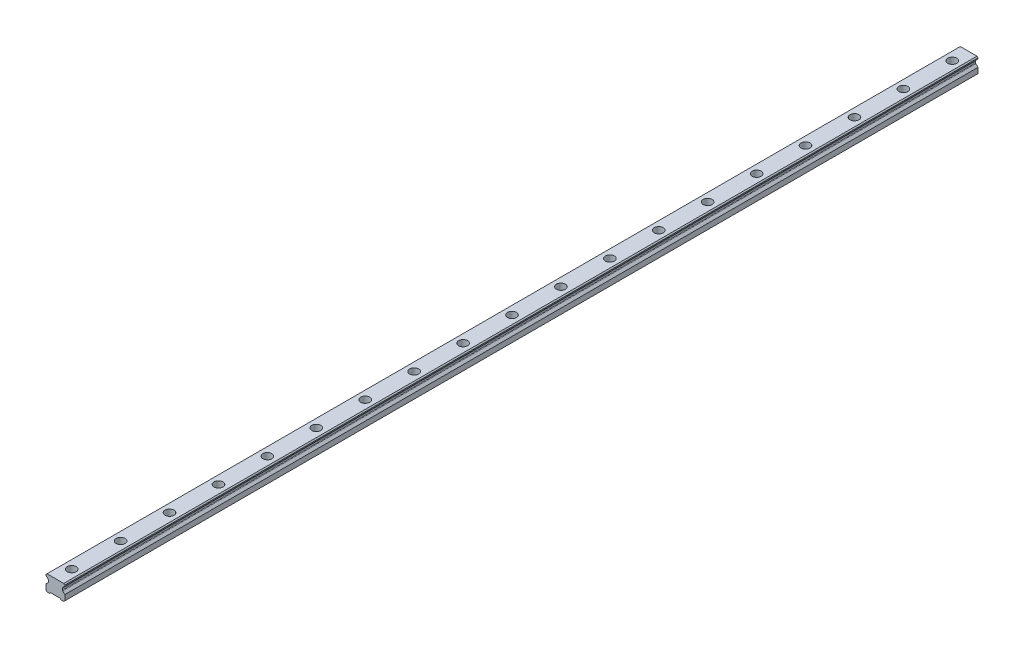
ISO-10303-21;
HEADER;
FILE_DESCRIPTION(('STEP AP214'),'2;1');
FILE_NAME('part.step','',(''),(''),'','','');
FILE_SCHEMA(('AUTOMOTIVE_DESIGN { 1 0 10303 214 1 1 1 1 }'));
ENDSEC;
DATA;
#1=APPLICATION_CONTEXT('core data for automotive mechanical design processes');
#2=APPLICATION_PROTOCOL_DEFINITION('international standard','automotive_design',2000,#1);
#3=PRODUCT_CONTEXT('',#1,'mechanical');
#4=PRODUCT('Part','Part','',(#3));
#5=PRODUCT_RELATED_PRODUCT_CATEGORY('part','',(#4));
#6=PRODUCT_DEFINITION_FORMATION('','',#4);
#7=PRODUCT_DEFINITION_CONTEXT('part definition',#1,'design');
#8=PRODUCT_DEFINITION('design','',#6,#7);
#9=PRODUCT_DEFINITION_SHAPE('','',#8);
#10=(LENGTH_UNIT() NAMED_UNIT(*) SI_UNIT(.MILLI.,.METRE.));
#11=(NAMED_UNIT(*) PLANE_ANGLE_UNIT() SI_UNIT($,.RADIAN.));
#12=(NAMED_UNIT(*) SI_UNIT($,.STERADIAN.) SOLID_ANGLE_UNIT());
#13=UNCERTAINTY_MEASURE_WITH_UNIT(LENGTH_MEASURE(1.E-05),#10,'distance_accuracy_value','');
#14=(GEOMETRIC_REPRESENTATION_CONTEXT(3) GLOBAL_UNCERTAINTY_ASSIGNED_CONTEXT((#13)) GLOBAL_UNIT_ASSIGNED_CONTEXT((#10,
#11,#12)) REPRESENTATION_CONTEXT('',''));
#15=CARTESIAN_POINT('',(0.,0.,0.));
#16=DIRECTION('',(0.,0.,1.));
#17=DIRECTION('',(1.,0.,0.));
#18=AXIS2_PLACEMENT_3D('',#15,#16,#17);
#19=CARTESIAN_POINT('',(0.,10.2,-540.));
#20=DIRECTION('',(0.,1.,0.));
#21=DIRECTION('',(0.,0.,1.));
#22=AXIS2_PLACEMENT_3D('',#19,#20,#21);
#23=PLANE('',#22);
#24=CARTESIAN_POINT('',(0.,10.2,-540.));
#25=DIRECTION('',(0.,1.,0.));
#26=DIRECTION('',(0.,0.,1.));
#27=AXIS2_PLACEMENT_3D('',#24,#25,#26);
#28=CIRCLE('',#27,3.5);
#29=CARTESIAN_POINT('',(0.,10.2,-536.5));
#30=VERTEX_POINT('',#29);
#31=EDGE_CURVE('E493',#30,#30,#28,.T.);
#32=ORIENTED_EDGE('',*,*,#31,.F.);
#33=EDGE_LOOP('',(#32));
#34=FACE_BOUND('',#33,.T.);
#35=CARTESIAN_POINT('',(0.,10.2,-540.));
#36=DIRECTION('',(0.,1.,0.));
#37=DIRECTION('',(0.,0.,1.));
#38=AXIS2_PLACEMENT_3D('',#35,#36,#37);
#39=CIRCLE('',#38,5.5);
#40=CARTESIAN_POINT('',(0.,10.2,-534.5));
#41=VERTEX_POINT('',#40);
#42=EDGE_CURVE('E11',#41,#41,#39,.T.);
#43=ORIENTED_EDGE('',*,*,#42,.T.);
#44=EDGE_LOOP('',(#43));
#45=FACE_BOUND('',#44,.T.);
#46=ADVANCED_FACE('F39',(#34,#45),#23,.T.);
#47=CARTESIAN_POINT('',(0.,10.2,-540.));
#48=DIRECTION('',(0.,1.,0.));
#49=DIRECTION('',(0.,0.,1.));
#50=AXIS2_PLACEMENT_3D('',#47,#48,#49);
#51=CYLINDRICAL_SURFACE('',#50,5.5);
#52=ORIENTED_EDGE('',*,*,#42,.F.);
#53=EDGE_LOOP('',(#52));
#54=FACE_BOUND('',#53,.T.);
#55=CARTESIAN_POINT('',(0.,19.2,-540.));
#56=DIRECTION('',(0.,1.,0.));
#57=DIRECTION('',(0.,0.,1.));
#58=AXIS2_PLACEMENT_3D('',#55,#56,#57);
#59=CIRCLE('',#58,5.5);
#60=CARTESIAN_POINT('',(0.,19.2,-534.5));
#61=VERTEX_POINT('',#60);
#62=EDGE_CURVE('E48',#61,#61,#59,.T.);
#63=ORIENTED_EDGE('',*,*,#62,.T.);
#64=EDGE_LOOP('',(#63));
#65=FACE_BOUND('',#64,.T.);
#66=ADVANCED_FACE('F840',(#54,#65),#51,.F.);
#67=CARTESIAN_POINT('',(0.,10.2,-480.));
#68=DIRECTION('',(0.,1.,0.));
#69=DIRECTION('',(0.,0.,1.));
#70=AXIS2_PLACEMENT_3D('',#67,#68,#69);
#71=PLANE('',#70);
#72=CARTESIAN_POINT('',(0.,10.2,-480.));
#73=DIRECTION('',(0.,1.,0.));
#74=DIRECTION('',(0.,0.,1.));
#75=AXIS2_PLACEMENT_3D('',#72,#73,#74);
#76=CIRCLE('',#75,3.5);
#77=CARTESIAN_POINT('',(0.,10.2,-476.5));
#78=VERTEX_POINT('',#77);
#79=EDGE_CURVE('E498',#78,#78,#76,.T.);
#80=ORIENTED_EDGE('',*,*,#79,.F.);
#81=EDGE_LOOP('',(#80));
#82=FACE_BOUND('',#81,.T.);
#83=CARTESIAN_POINT('',(0.,10.2,-480.));
#84=DIRECTION('',(0.,1.,0.));
#85=DIRECTION('',(0.,0.,1.));
#86=AXIS2_PLACEMENT_3D('',#83,#84,#85);
#87=CIRCLE('',#86,5.5);
#88=CARTESIAN_POINT('',(0.,10.2,-474.5));
#89=VERTEX_POINT('',#88);
#90=EDGE_CURVE('E477',#89,#89,#87,.T.);
#91=ORIENTED_EDGE('',*,*,#90,.T.);
#92=EDGE_LOOP('',(#91));
#93=FACE_BOUND('',#92,.T.);
#94=ADVANCED_FACE('F842',(#82,#93),#71,.T.);
#95=CARTESIAN_POINT('',(0.,10.2,-480.));
#96=DIRECTION('',(0.,1.,0.));
#97=DIRECTION('',(0.,0.,1.));
#98=AXIS2_PLACEMENT_3D('',#95,#96,#97);
#99=CYLINDRICAL_SURFACE('',#98,5.5);
#100=ORIENTED_EDGE('',*,*,#90,.F.);
#101=EDGE_LOOP('',(#100));
#102=FACE_BOUND('',#101,.T.);
#103=CARTESIAN_POINT('',(0.,19.2,-480.));
#104=DIRECTION('',(0.,1.,0.));
#105=DIRECTION('',(0.,0.,1.));
#106=AXIS2_PLACEMENT_3D('',#103,#104,#105);
#107=CIRCLE('',#106,5.5);
#108=CARTESIAN_POINT('',(0.,19.2,-474.5));
#109=VERTEX_POINT('',#108);
#110=EDGE_CURVE('E473',#109,#109,#107,.T.);
#111=ORIENTED_EDGE('',*,*,#110,.T.);
#112=EDGE_LOOP('',(#111));
#113=FACE_BOUND('',#112,.T.);
#114=ADVANCED_FACE('F848',(#102,#113),#99,.F.);
#115=CARTESIAN_POINT('',(0.,10.2,-420.));
#116=DIRECTION('',(0.,1.,0.));
#117=DIRECTION('',(0.,0.,1.));
#118=AXIS2_PLACEMENT_3D('',#115,#116,#117);
#119=PLANE('',#118);
#120=CARTESIAN_POINT('',(0.,10.2,-420.));
#121=DIRECTION('',(0.,1.,0.));
#122=DIRECTION('',(0.,0.,1.));
#123=AXIS2_PLACEMENT_3D('',#120,#121,#122);
#124=CIRCLE('',#123,3.5);
#125=CARTESIAN_POINT('',(0.,10.2,-416.5));
#126=VERTEX_POINT('',#125);
#127=EDGE_CURVE('E503',#126,#126,#124,.T.);
#128=ORIENTED_EDGE('',*,*,#127,.F.);
#129=EDGE_LOOP('',(#128));
#130=FACE_BOUND('',#129,.T.);
#131=CARTESIAN_POINT('',(0.,10.2,-420.));
#132=DIRECTION('',(0.,1.,0.));
#133=DIRECTION('',(0.,0.,1.));
#134=AXIS2_PLACEMENT_3D('',#131,#132,#133);
#135=CIRCLE('',#134,5.5);
#136=CARTESIAN_POINT('',(0.,10.2,-414.5));
#137=VERTEX_POINT('',#136);
#138=EDGE_CURVE('E469',#137,#137,#135,.T.);
#139=ORIENTED_EDGE('',*,*,#138,.T.);
#140=EDGE_LOOP('',(#139));
#141=FACE_BOUND('',#140,.T.);
#142=ADVANCED_FACE('F856',(#130,#141),#119,.T.);
#143=CARTESIAN_POINT('',(0.,10.2,-420.));
#144=DIRECTION('',(0.,1.,0.));
#145=DIRECTION('',(0.,0.,1.));
#146=AXIS2_PLACEMENT_3D('',#143,#144,#145);
#147=CYLINDRICAL_SURFACE('',#146,5.5);
#148=ORIENTED_EDGE('',*,*,#138,.F.);
#149=EDGE_LOOP('',(#148));
#150=FACE_BOUND('',#149,.T.);
#151=CARTESIAN_POINT('',(0.,19.2,-420.));
#152=DIRECTION('',(0.,1.,0.));
#153=DIRECTION('',(0.,0.,1.));
#154=AXIS2_PLACEMENT_3D('',#151,#152,#153);
#155=CIRCLE('',#154,5.5);
#156=CARTESIAN_POINT('',(0.,19.2,-414.5));
#157=VERTEX_POINT('',#156);
#158=EDGE_CURVE('E465',#157,#157,#155,.T.);
#159=ORIENTED_EDGE('',*,*,#158,.T.);
#160=EDGE_LOOP('',(#159));
#161=FACE_BOUND('',#160,.T.);
#162=ADVANCED_FACE('F860',(#150,#161),#147,.F.);
#163=CARTESIAN_POINT('',(0.,10.2,-360.));
#164=DIRECTION('',(0.,1.,0.));
#165=DIRECTION('',(0.,0.,1.));
#166=AXIS2_PLACEMENT_3D('',#163,#164,#165);
#167=PLANE('',#166);
#168=CARTESIAN_POINT('',(0.,10.2,-360.));
#169=DIRECTION('',(0.,1.,0.));
#170=DIRECTION('',(0.,0.,1.));
#171=AXIS2_PLACEMENT_3D('',#168,#169,#170);
#172=CIRCLE('',#171,3.5);
#173=CARTESIAN_POINT('',(0.,10.2,-356.5));
#174=VERTEX_POINT('',#173);
#175=EDGE_CURVE('E508',#174,#174,#172,.T.);
#176=ORIENTED_EDGE('',*,*,#175,.F.);
#177=EDGE_LOOP('',(#176));
#178=FACE_BOUND('',#177,.T.);
#179=CARTESIAN_POINT('',(0.,10.2,-360.));
#180=DIRECTION('',(0.,1.,0.));
#181=DIRECTION('',(0.,0.,1.));
#182=AXIS2_PLACEMENT_3D('',#179,#180,#181);
#183=CIRCLE('',#182,5.5);
#184=CARTESIAN_POINT('',(0.,10.2,-354.5));
#185=VERTEX_POINT('',#184);
#186=EDGE_CURVE('E461',#185,#185,#183,.T.);
#187=ORIENTED_EDGE('',*,*,#186,.T.);
#188=EDGE_LOOP('',(#187));
#189=FACE_BOUND('',#188,.T.);
#190=ADVANCED_FACE('F864',(#178,#189),#167,.T.);
#191=CARTESIAN_POINT('',(0.,10.2,-360.));
#192=DIRECTION('',(0.,1.,0.));
#193=DIRECTION('',(0.,0.,1.));
#194=AXIS2_PLACEMENT_3D('',#191,#192,#193);
#195=CYLINDRICAL_SURFACE('',#194,5.5);
#196=ORIENTED_EDGE('',*,*,#186,.F.);
#197=EDGE_LOOP('',(#196));
#198=FACE_BOUND('',#197,.T.);
#199=CARTESIAN_POINT('',(0.,19.2,-360.));
#200=DIRECTION('',(0.,1.,0.));
#201=DIRECTION('',(0.,0.,1.));
#202=AXIS2_PLACEMENT_3D('',#199,#200,#201);
#203=CIRCLE('',#202,5.5);
#204=CARTESIAN_POINT('',(0.,19.2,-354.5));
#205=VERTEX_POINT('',#204);
#206=EDGE_CURVE('E457',#205,#205,#203,.T.);
#207=ORIENTED_EDGE('',*,*,#206,.T.);
#208=EDGE_LOOP('',(#207));
#209=FACE_BOUND('',#208,.T.);
#210=ADVANCED_FACE('F868',(#198,#209),#195,.F.);
#211=CARTESIAN_POINT('',(0.,10.2,-300.));
#212=DIRECTION('',(0.,1.,0.));
#213=DIRECTION('',(0.,0.,1.));
#214=AXIS2_PLACEMENT_3D('',#211,#212,#213);
#215=PLANE('',#214);
#216=CARTESIAN_POINT('',(0.,10.2,-300.));
#217=DIRECTION('',(0.,1.,0.));
#218=DIRECTION('',(0.,0.,1.));
#219=AXIS2_PLACEMENT_3D('',#216,#217,#218);
#220=CIRCLE('',#219,3.5);
#221=CARTESIAN_POINT('',(0.,10.2,-296.5));
#222=VERTEX_POINT('',#221);
#223=EDGE_CURVE('E513',#222,#222,#220,.T.);
#224=ORIENTED_EDGE('',*,*,#223,.F.);
#225=EDGE_LOOP('',(#224));
#226=FACE_BOUND('',#225,.T.);
#227=CARTESIAN_POINT('',(0.,10.2,-300.));
#228=DIRECTION('',(0.,1.,0.));
#229=DIRECTION('',(0.,0.,1.));
#230=AXIS2_PLACEMENT_3D('',#227,#228,#229);
#231=CIRCLE('',#230,5.5);
#232=CARTESIAN_POINT('',(0.,10.2,-294.5));
#233=VERTEX_POINT('',#232);
#234=EDGE_CURVE('E453',#233,#233,#231,.T.);
#235=ORIENTED_EDGE('',*,*,#234,.T.);
#236=EDGE_LOOP('',(#235));
#237=FACE_BOUND('',#236,.T.);
#238=ADVANCED_FACE('F872',(#226,#237),#215,.T.);
#239=CARTESIAN_POINT('',(0.,10.2,-300.));
#240=DIRECTION('',(0.,1.,0.));
#241=DIRECTION('',(0.,0.,1.));
#242=AXIS2_PLACEMENT_3D('',#239,#240,#241);
#243=CYLINDRICAL_SURFACE('',#242,5.5);
#244=ORIENTED_EDGE('',*,*,#234,.F.);
#245=EDGE_LOOP('',(#244));
#246=FACE_BOUND('',#245,.T.);
#247=CARTESIAN_POINT('',(0.,19.2,-300.));
#248=DIRECTION('',(0.,1.,0.));
#249=DIRECTION('',(0.,0.,1.));
#250=AXIS2_PLACEMENT_3D('',#247,#248,#249);
#251=CIRCLE('',#250,5.5);
#252=CARTESIAN_POINT('',(0.,19.2,-294.5));
#253=VERTEX_POINT('',#252);
#254=EDGE_CURVE('E449',#253,#253,#251,.T.);
#255=ORIENTED_EDGE('',*,*,#254,.T.);
#256=EDGE_LOOP('',(#255));
#257=FACE_BOUND('',#256,.T.);
#258=ADVANCED_FACE('F876',(#246,#257),#243,.F.);
#259=CARTESIAN_POINT('',(0.,10.2,-240.));
#260=DIRECTION('',(0.,1.,0.));
#261=DIRECTION('',(0.,0.,1.));
#262=AXIS2_PLACEMENT_3D('',#259,#260,#261);
#263=PLANE('',#262);
#264=CARTESIAN_POINT('',(0.,10.2,-240.));
#265=DIRECTION('',(0.,1.,0.));
#266=DIRECTION('',(0.,0.,1.));
#267=AXIS2_PLACEMENT_3D('',#264,#265,#266);
#268=CIRCLE('',#267,3.5);
#269=CARTESIAN_POINT('',(0.,10.2,-236.5));
#270=VERTEX_POINT('',#269);
#271=EDGE_CURVE('E518',#270,#270,#268,.T.);
#272=ORIENTED_EDGE('',*,*,#271,.F.);
#273=EDGE_LOOP('',(#272));
#274=FACE_BOUND('',#273,.T.);
#275=CARTESIAN_POINT('',(0.,10.2,-240.));
#276=DIRECTION('',(0.,1.,0.));
#277=DIRECTION('',(0.,0.,1.));
#278=AXIS2_PLACEMENT_3D('',#275,#276,#277);
#279=CIRCLE('',#278,5.5);
#280=CARTESIAN_POINT('',(0.,10.2,-234.5));
#281=VERTEX_POINT('',#280);
#282=EDGE_CURVE('E445',#281,#281,#279,.T.);
#283=ORIENTED_EDGE('',*,*,#282,.T.);
#284=EDGE_LOOP('',(#283));
#285=FACE_BOUND('',#284,.T.);
#286=ADVANCED_FACE('F880',(#274,#285),#263,.T.);
#287=CARTESIAN_POINT('',(0.,10.2,-240.));
#288=DIRECTION('',(0.,1.,0.));
#289=DIRECTION('',(0.,0.,1.));
#290=AXIS2_PLACEMENT_3D('',#287,#288,#289);
#291=CYLINDRICAL_SURFACE('',#290,5.5);
#292=ORIENTED_EDGE('',*,*,#282,.F.);
#293=EDGE_LOOP('',(#292));
#294=FACE_BOUND('',#293,.T.);
#295=CARTESIAN_POINT('',(0.,19.2,-240.));
#296=DIRECTION('',(0.,1.,0.));
#297=DIRECTION('',(0.,0.,1.));
#298=AXIS2_PLACEMENT_3D('',#295,#296,#297);
#299=CIRCLE('',#298,5.5);
#300=CARTESIAN_POINT('',(0.,19.2,-234.5));
#301=VERTEX_POINT('',#300);
#302=EDGE_CURVE('E441',#301,#301,#299,.T.);
#303=ORIENTED_EDGE('',*,*,#302,.T.);
#304=EDGE_LOOP('',(#303));
#305=FACE_BOUND('',#304,.T.);
#306=ADVANCED_FACE('F884',(#294,#305),#291,.F.);
#307=CARTESIAN_POINT('',(0.,10.2,-180.));
#308=DIRECTION('',(0.,1.,0.));
#309=DIRECTION('',(0.,0.,1.));
#310=AXIS2_PLACEMENT_3D('',#307,#308,#309);
#311=PLANE('',#310);
#312=CARTESIAN_POINT('',(0.,10.2,-180.));
#313=DIRECTION('',(0.,1.,0.));
#314=DIRECTION('',(0.,0.,1.));
#315=AXIS2_PLACEMENT_3D('',#312,#313,#314);
#316=CIRCLE('',#315,3.5);
#317=CARTESIAN_POINT('',(0.,10.2,-176.5));
#318=VERTEX_POINT('',#317);
#319=EDGE_CURVE('E523',#318,#318,#316,.T.);
#320=ORIENTED_EDGE('',*,*,#319,.F.);
#321=EDGE_LOOP('',(#320));
#322=FACE_BOUND('',#321,.T.);
#323=CARTESIAN_POINT('',(0.,10.2,-180.));
#324=DIRECTION('',(0.,1.,0.));
#325=DIRECTION('',(0.,0.,1.));
#326=AXIS2_PLACEMENT_3D('',#323,#324,#325);
#327=CIRCLE('',#326,5.5);
#328=CARTESIAN_POINT('',(0.,10.2,-174.5));
#329=VERTEX_POINT('',#328);
#330=EDGE_CURVE('E437',#329,#329,#327,.T.);
#331=ORIENTED_EDGE('',*,*,#330,.T.);
#332=EDGE_LOOP('',(#331));
#333=FACE_BOUND('',#332,.T.);
#334=ADVANCED_FACE('F888',(#322,#333),#311,.T.);
#335=CARTESIAN_POINT('',(0.,10.2,-180.));
#336=DIRECTION('',(0.,1.,0.));
#337=DIRECTION('',(0.,0.,1.));
#338=AXIS2_PLACEMENT_3D('',#335,#336,#337);
#339=CYLINDRICAL_SURFACE('',#338,5.5);
#340=ORIENTED_EDGE('',*,*,#330,.F.);
#341=EDGE_LOOP('',(#340));
#342=FACE_BOUND('',#341,.T.);
#343=CARTESIAN_POINT('',(0.,19.2,-180.));
#344=DIRECTION('',(0.,1.,0.));
#345=DIRECTION('',(0.,0.,1.));
#346=AXIS2_PLACEMENT_3D('',#343,#344,#345);
#347=CIRCLE('',#346,5.5);
#348=CARTESIAN_POINT('',(0.,19.2,-174.5));
#349=VERTEX_POINT('',#348);
#350=EDGE_CURVE('E433',#349,#349,#347,.T.);
#351=ORIENTED_EDGE('',*,*,#350,.T.);
#352=EDGE_LOOP('',(#351));
#353=FACE_BOUND('',#352,.T.);
#354=ADVANCED_FACE('F892',(#342,#353),#339,.F.);
#355=CARTESIAN_POINT('',(0.,10.2,-120.));
#356=DIRECTION('',(0.,1.,0.));
#357=DIRECTION('',(0.,0.,1.));
#358=AXIS2_PLACEMENT_3D('',#355,#356,#357);
#359=PLANE('',#358);
#360=CARTESIAN_POINT('',(0.,10.2,-120.));
#361=DIRECTION('',(0.,1.,0.));
#362=DIRECTION('',(0.,0.,1.));
#363=AXIS2_PLACEMENT_3D('',#360,#361,#362);
#364=CIRCLE('',#363,3.5);
#365=CARTESIAN_POINT('',(0.,10.2,-116.5));
#366=VERTEX_POINT('',#365);
#367=EDGE_CURVE('E528',#366,#366,#364,.T.);
#368=ORIENTED_EDGE('',*,*,#367,.F.);
#369=EDGE_LOOP('',(#368));
#370=FACE_BOUND('',#369,.T.);
#371=CARTESIAN_POINT('',(0.,10.2,-120.));
#372=DIRECTION('',(0.,1.,0.));
#373=DIRECTION('',(0.,0.,1.));
#374=AXIS2_PLACEMENT_3D('',#371,#372,#373);
#375=CIRCLE('',#374,5.5);
#376=CARTESIAN_POINT('',(0.,10.2,-114.5));
#377=VERTEX_POINT('',#376);
#378=EDGE_CURVE('E429',#377,#377,#375,.T.);
#379=ORIENTED_EDGE('',*,*,#378,.T.);
#380=EDGE_LOOP('',(#379));
#381=FACE_BOUND('',#380,.T.);
#382=ADVANCED_FACE('F896',(#370,#381),#359,.T.);
#383=CARTESIAN_POINT('',(0.,10.2,-120.));
#384=DIRECTION('',(0.,1.,0.));
#385=DIRECTION('',(0.,0.,1.));
#386=AXIS2_PLACEMENT_3D('',#383,#384,#385);
#387=CYLINDRICAL_SURFACE('',#386,5.5);
#388=ORIENTED_EDGE('',*,*,#378,.F.);
#389=EDGE_LOOP('',(#388));
#390=FACE_BOUND('',#389,.T.);
#391=CARTESIAN_POINT('',(0.,19.2,-120.));
#392=DIRECTION('',(0.,1.,0.));
#393=DIRECTION('',(0.,0.,1.));
#394=AXIS2_PLACEMENT_3D('',#391,#392,#393);
#395=CIRCLE('',#394,5.5);
#396=CARTESIAN_POINT('',(0.,19.2,-114.5));
#397=VERTEX_POINT('',#396);
#398=EDGE_CURVE('E425',#397,#397,#395,.T.);
#399=ORIENTED_EDGE('',*,*,#398,.T.);
#400=EDGE_LOOP('',(#399));
#401=FACE_BOUND('',#400,.T.);
#402=ADVANCED_FACE('F900',(#390,#401),#387,.F.);
#403=CARTESIAN_POINT('',(0.,10.2,-60.));
#404=DIRECTION('',(0.,1.,0.));
#405=DIRECTION('',(0.,0.,1.));
#406=AXIS2_PLACEMENT_3D('',#403,#404,#405);
#407=PLANE('',#406);
#408=CARTESIAN_POINT('',(0.,10.2,-59.9999999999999));
#409=DIRECTION('',(0.,1.,0.));
#410=DIRECTION('',(0.,0.,1.));
#411=AXIS2_PLACEMENT_3D('',#408,#409,#410);
#412=CIRCLE('',#411,3.5);
#413=CARTESIAN_POINT('',(0.,10.2,-56.4999999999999));
#414=VERTEX_POINT('',#413);
#415=EDGE_CURVE('E533',#414,#414,#412,.T.);
#416=ORIENTED_EDGE('',*,*,#415,.F.);
#417=EDGE_LOOP('',(#416));
#418=FACE_BOUND('',#417,.T.);
#419=CARTESIAN_POINT('',(0.,10.2,-60.));
#420=DIRECTION('',(0.,1.,0.));
#421=DIRECTION('',(0.,0.,1.));
#422=AXIS2_PLACEMENT_3D('',#419,#420,#421);
#423=CIRCLE('',#422,5.5);
#424=CARTESIAN_POINT('',(0.,10.2,-54.5));
#425=VERTEX_POINT('',#424);
#426=EDGE_CURVE('E421',#425,#425,#423,.T.);
#427=ORIENTED_EDGE('',*,*,#426,.T.);
#428=EDGE_LOOP('',(#427));
#429=FACE_BOUND('',#428,.T.);
#430=ADVANCED_FACE('F904',(#418,#429),#407,.T.);
#431=CARTESIAN_POINT('',(0.,10.2,-60.));
#432=DIRECTION('',(0.,1.,0.));
#433=DIRECTION('',(0.,0.,1.));
#434=AXIS2_PLACEMENT_3D('',#431,#432,#433);
#435=CYLINDRICAL_SURFACE('',#434,5.5);
#436=ORIENTED_EDGE('',*,*,#426,.F.);
#437=EDGE_LOOP('',(#436));
#438=FACE_BOUND('',#437,.T.);
#439=CARTESIAN_POINT('',(0.,19.2,-60.));
#440=DIRECTION('',(0.,1.,0.));
#441=DIRECTION('',(0.,0.,1.));
#442=AXIS2_PLACEMENT_3D('',#439,#440,#441);
#443=CIRCLE('',#442,5.5);
#444=CARTESIAN_POINT('',(0.,19.2,-54.5));
#445=VERTEX_POINT('',#444);
#446=EDGE_CURVE('E417',#445,#445,#443,.T.);
#447=ORIENTED_EDGE('',*,*,#446,.T.);
#448=EDGE_LOOP('',(#447));
#449=FACE_BOUND('',#448,.T.);
#450=ADVANCED_FACE('F908',(#438,#449),#435,.F.);
#451=CARTESIAN_POINT('',(0.,10.2,0.));
#452=DIRECTION('',(0.,1.,0.));
#453=DIRECTION('',(0.,0.,1.));
#454=AXIS2_PLACEMENT_3D('',#451,#452,#453);
#455=PLANE('',#454);
#456=CARTESIAN_POINT('',(0.,10.2,0.));
#457=DIRECTION('',(0.,1.,0.));
#458=DIRECTION('',(0.,0.,1.));
#459=AXIS2_PLACEMENT_3D('',#456,#457,#458);
#460=CIRCLE('',#459,3.5);
#461=CARTESIAN_POINT('',(0.,10.2,3.5));
#462=VERTEX_POINT('',#461);
#463=EDGE_CURVE('E538',#462,#462,#460,.T.);
#464=ORIENTED_EDGE('',*,*,#463,.F.);
#465=EDGE_LOOP('',(#464));
#466=FACE_BOUND('',#465,.T.);
#467=CARTESIAN_POINT('',(0.,10.2,0.));
#468=DIRECTION('',(0.,1.,0.));
#469=DIRECTION('',(0.,0.,1.));
#470=AXIS2_PLACEMENT_3D('',#467,#468,#469);
#471=CIRCLE('',#470,5.5);
#472=CARTESIAN_POINT('',(0.,10.2,5.5));
#473=VERTEX_POINT('',#472);
#474=EDGE_CURVE('E413',#473,#473,#471,.T.);
#475=ORIENTED_EDGE('',*,*,#474,.T.);
#476=EDGE_LOOP('',(#475));
#477=FACE_BOUND('',#476,.T.);
#478=ADVANCED_FACE('F912',(#466,#477),#455,.T.);
#479=CARTESIAN_POINT('',(0.,10.2,0.));
#480=DIRECTION('',(0.,1.,0.));
#481=DIRECTION('',(0.,0.,1.));
#482=AXIS2_PLACEMENT_3D('',#479,#480,#481);
#483=CYLINDRICAL_SURFACE('',#482,5.5);
#484=ORIENTED_EDGE('',*,*,#474,.F.);
#485=EDGE_LOOP('',(#484));
#486=FACE_BOUND('',#485,.T.);
#487=CARTESIAN_POINT('',(0.,19.2,0.));
#488=DIRECTION('',(0.,1.,0.));
#489=DIRECTION('',(0.,0.,1.));
#490=AXIS2_PLACEMENT_3D('',#487,#488,#489);
#491=CIRCLE('',#490,5.5);
#492=CARTESIAN_POINT('',(0.,19.2,5.5));
#493=VERTEX_POINT('',#492);
#494=EDGE_CURVE('E409',#493,#493,#491,.T.);
#495=ORIENTED_EDGE('',*,*,#494,.T.);
#496=EDGE_LOOP('',(#495));
#497=FACE_BOUND('',#496,.T.);
#498=ADVANCED_FACE('F916',(#486,#497),#483,.F.);
#499=CARTESIAN_POINT('',(0.,10.2,60.0000000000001));
#500=DIRECTION('',(0.,1.,0.));
#501=DIRECTION('',(0.,0.,1.));
#502=AXIS2_PLACEMENT_3D('',#499,#500,#501);
#503=PLANE('',#502);
#504=CARTESIAN_POINT('',(0.,10.2,60.0000000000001));
#505=DIRECTION('',(0.,1.,0.));
#506=DIRECTION('',(0.,0.,1.));
#507=AXIS2_PLACEMENT_3D('',#504,#505,#506);
#508=CIRCLE('',#507,3.5);
#509=CARTESIAN_POINT('',(0.,10.2,63.5000000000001));
#510=VERTEX_POINT('',#509);
#511=EDGE_CURVE('E543',#510,#510,#508,.T.);
#512=ORIENTED_EDGE('',*,*,#511,.F.);
#513=EDGE_LOOP('',(#512));
#514=FACE_BOUND('',#513,.T.);
#515=CARTESIAN_POINT('',(0.,10.2,60.0000000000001));
#516=DIRECTION('',(0.,1.,0.));
#517=DIRECTION('',(0.,0.,1.));
#518=AXIS2_PLACEMENT_3D('',#515,#516,#517);
#519=CIRCLE('',#518,5.5);
#520=CARTESIAN_POINT('',(0.,10.2,65.5000000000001));
#521=VERTEX_POINT('',#520);
#522=EDGE_CURVE('E405',#521,#521,#519,.T.);
#523=ORIENTED_EDGE('',*,*,#522,.T.);
#524=EDGE_LOOP('',(#523));
#525=FACE_BOUND('',#524,.T.);
#526=ADVANCED_FACE('F920',(#514,#525),#503,.T.);
#527=CARTESIAN_POINT('',(0.,10.2,60.0000000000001));
#528=DIRECTION('',(0.,1.,0.));
#529=DIRECTION('',(0.,0.,1.));
#530=AXIS2_PLACEMENT_3D('',#527,#528,#529);
#531=CYLINDRICAL_SURFACE('',#530,5.5);
#532=ORIENTED_EDGE('',*,*,#522,.F.);
#533=EDGE_LOOP('',(#532));
#534=FACE_BOUND('',#533,.T.);
#535=CARTESIAN_POINT('',(0.,19.2,60.0000000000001));
#536=DIRECTION('',(0.,1.,0.));
#537=DIRECTION('',(0.,0.,1.));
#538=AXIS2_PLACEMENT_3D('',#535,#536,#537);
#539=CIRCLE('',#538,5.5);
#540=CARTESIAN_POINT('',(0.,19.2,65.5000000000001));
#541=VERTEX_POINT('',#540);
#542=EDGE_CURVE('E401',#541,#541,#539,.T.);
#543=ORIENTED_EDGE('',*,*,#542,.T.);
#544=EDGE_LOOP('',(#543));
#545=FACE_BOUND('',#544,.T.);
#546=ADVANCED_FACE('F924',(#534,#545),#531,.F.);
#547=CARTESIAN_POINT('',(0.,10.2,120.));
#548=DIRECTION('',(0.,1.,0.));
#549=DIRECTION('',(0.,0.,1.));
#550=AXIS2_PLACEMENT_3D('',#547,#548,#549);
#551=PLANE('',#550);
#552=CARTESIAN_POINT('',(0.,10.2,120.));
#553=DIRECTION('',(0.,1.,0.));
#554=DIRECTION('',(0.,0.,1.));
#555=AXIS2_PLACEMENT_3D('',#552,#553,#554);
#556=CIRCLE('',#555,3.5);
#557=CARTESIAN_POINT('',(0.,10.2,123.5));
#558=VERTEX_POINT('',#557);
#559=EDGE_CURVE('E548',#558,#558,#556,.T.);
#560=ORIENTED_EDGE('',*,*,#559,.F.);
#561=EDGE_LOOP('',(#560));
#562=FACE_BOUND('',#561,.T.);
#563=CARTESIAN_POINT('',(0.,10.2,120.));
#564=DIRECTION('',(0.,1.,0.));
#565=DIRECTION('',(0.,0.,1.));
#566=AXIS2_PLACEMENT_3D('',#563,#564,#565);
#567=CIRCLE('',#566,5.5);
#568=CARTESIAN_POINT('',(0.,10.2,125.5));
#569=VERTEX_POINT('',#568);
#570=EDGE_CURVE('E397',#569,#569,#567,.T.);
#571=ORIENTED_EDGE('',*,*,#570,.T.);
#572=EDGE_LOOP('',(#571));
#573=FACE_BOUND('',#572,.T.);
#574=ADVANCED_FACE('F928',(#562,#573),#551,.T.);
#575=CARTESIAN_POINT('',(0.,10.2,120.));
#576=DIRECTION('',(0.,1.,0.));
#577=DIRECTION('',(0.,0.,1.));
#578=AXIS2_PLACEMENT_3D('',#575,#576,#577);
#579=CYLINDRICAL_SURFACE('',#578,5.5);
#580=ORIENTED_EDGE('',*,*,#570,.F.);
#581=EDGE_LOOP('',(#580));
#582=FACE_BOUND('',#581,.T.);
#583=CARTESIAN_POINT('',(0.,19.2,120.));
#584=DIRECTION('',(0.,1.,0.));
#585=DIRECTION('',(0.,0.,1.));
#586=AXIS2_PLACEMENT_3D('',#583,#584,#585);
#587=CIRCLE('',#586,5.5);
#588=CARTESIAN_POINT('',(0.,19.2,125.5));
#589=VERTEX_POINT('',#588);
#590=EDGE_CURVE('E393',#589,#589,#587,.T.);
#591=ORIENTED_EDGE('',*,*,#590,.T.);
#592=EDGE_LOOP('',(#591));
#593=FACE_BOUND('',#592,.T.);
#594=ADVANCED_FACE('F800',(#582,#593),#579,.F.);
#595=CARTESIAN_POINT('',(0.,10.2,180.));
#596=DIRECTION('',(0.,1.,0.));
#597=DIRECTION('',(0.,0.,1.));
#598=AXIS2_PLACEMENT_3D('',#595,#596,#597);
#599=PLANE('',#598);
#600=CARTESIAN_POINT('',(0.,10.2,180.));
#601=DIRECTION('',(0.,1.,0.));
#602=DIRECTION('',(0.,0.,1.));
#603=AXIS2_PLACEMENT_3D('',#600,#601,#602);
#604=CIRCLE('',#603,3.5);
#605=CARTESIAN_POINT('',(0.,10.2,183.5));
#606=VERTEX_POINT('',#605);
#607=EDGE_CURVE('E553',#606,#606,#604,.T.);
#608=ORIENTED_EDGE('',*,*,#607,.F.);
#609=EDGE_LOOP('',(#608));
#610=FACE_BOUND('',#609,.T.);
#611=CARTESIAN_POINT('',(0.,10.2,180.));
#612=DIRECTION('',(0.,1.,0.));
#613=DIRECTION('',(0.,0.,1.));
#614=AXIS2_PLACEMENT_3D('',#611,#612,#613);
#615=CIRCLE('',#614,5.5);
#616=CARTESIAN_POINT('',(0.,10.2,185.5));
#617=VERTEX_POINT('',#616);
#618=EDGE_CURVE('E389',#617,#617,#615,.T.);
#619=ORIENTED_EDGE('',*,*,#618,.T.);
#620=EDGE_LOOP('',(#619));
#621=FACE_BOUND('',#620,.T.);
#622=ADVANCED_FACE('F796',(#610,#621),#599,.T.);
#623=CARTESIAN_POINT('',(0.,10.2,180.));
#624=DIRECTION('',(0.,1.,0.));
#625=DIRECTION('',(0.,0.,1.));
#626=AXIS2_PLACEMENT_3D('',#623,#624,#625);
#627=CYLINDRICAL_SURFACE('',#626,5.5);
#628=ORIENTED_EDGE('',*,*,#618,.F.);
#629=EDGE_LOOP('',(#628));
#630=FACE_BOUND('',#629,.T.);
#631=CARTESIAN_POINT('',(0.,19.2,180.));
#632=DIRECTION('',(0.,1.,0.));
#633=DIRECTION('',(0.,0.,1.));
#634=AXIS2_PLACEMENT_3D('',#631,#632,#633);
#635=CIRCLE('',#634,5.5);
#636=CARTESIAN_POINT('',(0.,19.2,185.5));
#637=VERTEX_POINT('',#636);
#638=EDGE_CURVE('E385',#637,#637,#635,.T.);
#639=ORIENTED_EDGE('',*,*,#638,.T.);
#640=EDGE_LOOP('',(#639));
#641=FACE_BOUND('',#640,.T.);
#642=ADVANCED_FACE('F799',(#630,#641),#627,.F.);
#643=CARTESIAN_POINT('',(0.,10.2,240.));
#644=DIRECTION('',(0.,1.,0.));
#645=DIRECTION('',(0.,0.,1.));
#646=AXIS2_PLACEMENT_3D('',#643,#644,#645);
#647=PLANE('',#646);
#648=CARTESIAN_POINT('',(0.,10.2,240.));
#649=DIRECTION('',(0.,1.,0.));
#650=DIRECTION('',(0.,0.,1.));
#651=AXIS2_PLACEMENT_3D('',#648,#649,#650);
#652=CIRCLE('',#651,3.5);
#653=CARTESIAN_POINT('',(0.,10.2,243.5));
#654=VERTEX_POINT('',#653);
#655=EDGE_CURVE('E558',#654,#654,#652,.T.);
#656=ORIENTED_EDGE('',*,*,#655,.F.);
#657=EDGE_LOOP('',(#656));
#658=FACE_BOUND('',#657,.T.);
#659=CARTESIAN_POINT('',(0.,10.2,240.));
#660=DIRECTION('',(0.,1.,0.));
#661=DIRECTION('',(0.,0.,1.));
#662=AXIS2_PLACEMENT_3D('',#659,#660,#661);
#663=CIRCLE('',#662,5.5);
#664=CARTESIAN_POINT('',(0.,10.2,245.5));
#665=VERTEX_POINT('',#664);
#666=EDGE_CURVE('E381',#665,#665,#663,.T.);
#667=ORIENTED_EDGE('',*,*,#666,.T.);
#668=EDGE_LOOP('',(#667));
#669=FACE_BOUND('',#668,.T.);
#670=ADVANCED_FACE('F806',(#658,#669),#647,.T.);
#671=CARTESIAN_POINT('',(0.,10.2,240.));
#672=DIRECTION('',(0.,1.,0.));
#673=DIRECTION('',(0.,0.,1.));
#674=AXIS2_PLACEMENT_3D('',#671,#672,#673);
#675=CYLINDRICAL_SURFACE('',#674,5.5);
#676=ORIENTED_EDGE('',*,*,#666,.F.);
#677=EDGE_LOOP('',(#676));
#678=FACE_BOUND('',#677,.T.);
#679=CARTESIAN_POINT('',(0.,19.2,240.));
#680=DIRECTION('',(0.,1.,0.));
#681=DIRECTION('',(0.,0.,1.));
#682=AXIS2_PLACEMENT_3D('',#679,#680,#681);
#683=CIRCLE('',#682,5.5);
#684=CARTESIAN_POINT('',(0.,19.2,245.5));
#685=VERTEX_POINT('',#684);
#686=EDGE_CURVE('E377',#685,#685,#683,.T.);
#687=ORIENTED_EDGE('',*,*,#686,.T.);
#688=EDGE_LOOP('',(#687));
#689=FACE_BOUND('',#688,.T.);
#690=ADVANCED_FACE('F938',(#678,#689),#675,.F.);
#691=CARTESIAN_POINT('',(0.,10.2,300.));
#692=DIRECTION('',(0.,1.,0.));
#693=DIRECTION('',(0.,0.,1.));
#694=AXIS2_PLACEMENT_3D('',#691,#692,#693);
#695=PLANE('',#694);
#696=CARTESIAN_POINT('',(0.,10.2,300.));
#697=DIRECTION('',(0.,1.,0.));
#698=DIRECTION('',(0.,0.,1.));
#699=AXIS2_PLACEMENT_3D('',#696,#697,#698);
#700=CIRCLE('',#699,3.5);
#701=CARTESIAN_POINT('',(0.,10.2,303.5));
#702=VERTEX_POINT('',#701);
#703=EDGE_CURVE('E562',#702,#702,#700,.T.);
#704=ORIENTED_EDGE('',*,*,#703,.F.);
#705=EDGE_LOOP('',(#704));
#706=FACE_BOUND('',#705,.T.);
#707=CARTESIAN_POINT('',(0.,10.2,300.));
#708=DIRECTION('',(0.,1.,0.));
#709=DIRECTION('',(0.,0.,1.));
#710=AXIS2_PLACEMENT_3D('',#707,#708,#709);
#711=CIRCLE('',#710,5.5);
#712=CARTESIAN_POINT('',(0.,10.2,305.5));
#713=VERTEX_POINT('',#712);
#714=EDGE_CURVE('E373',#713,#713,#711,.T.);
#715=ORIENTED_EDGE('',*,*,#714,.T.);
#716=EDGE_LOOP('',(#715));
#717=FACE_BOUND('',#716,.T.);
#718=ADVANCED_FACE('F942',(#706,#717),#695,.T.);
#719=CARTESIAN_POINT('',(0.,10.2,300.));
#720=DIRECTION('',(0.,1.,0.));
#721=DIRECTION('',(0.,0.,1.));
#722=AXIS2_PLACEMENT_3D('',#719,#720,#721);
#723=CYLINDRICAL_SURFACE('',#722,5.5);
#724=ORIENTED_EDGE('',*,*,#714,.F.);
#725=EDGE_LOOP('',(#724));
#726=FACE_BOUND('',#725,.T.);
#727=CARTESIAN_POINT('',(0.,19.2,300.));
#728=DIRECTION('',(0.,1.,0.));
#729=DIRECTION('',(0.,0.,1.));
#730=AXIS2_PLACEMENT_3D('',#727,#728,#729);
#731=CIRCLE('',#730,5.5);
#732=CARTESIAN_POINT('',(0.,19.2,305.5));
#733=VERTEX_POINT('',#732);
#734=EDGE_CURVE('E369',#733,#733,#731,.T.);
#735=ORIENTED_EDGE('',*,*,#734,.T.);
#736=EDGE_LOOP('',(#735));
#737=FACE_BOUND('',#736,.T.);
#738=ADVANCED_FACE('F946',(#726,#737),#723,.F.);
#739=CARTESIAN_POINT('',(0.,10.2,360.));
#740=DIRECTION('',(0.,1.,0.));
#741=DIRECTION('',(0.,0.,1.));
#742=AXIS2_PLACEMENT_3D('',#739,#740,#741);
#743=PLANE('',#742);
#744=CARTESIAN_POINT('',(0.,10.2,360.));
#745=DIRECTION('',(0.,1.,0.));
#746=DIRECTION('',(0.,0.,1.));
#747=AXIS2_PLACEMENT_3D('',#744,#745,#746);
#748=CIRCLE('',#747,3.5);
#749=CARTESIAN_POINT('',(0.,10.2,363.5));
#750=VERTEX_POINT('',#749);
#751=EDGE_CURVE('E566',#750,#750,#748,.T.);
#752=ORIENTED_EDGE('',*,*,#751,.F.);
#753=EDGE_LOOP('',(#752));
#754=FACE_BOUND('',#753,.T.);
#755=CARTESIAN_POINT('',(0.,10.2,360.));
#756=DIRECTION('',(0.,1.,0.));
#757=DIRECTION('',(0.,0.,1.));
#758=AXIS2_PLACEMENT_3D('',#755,#756,#757);
#759=CIRCLE('',#758,5.5);
#760=CARTESIAN_POINT('',(0.,10.2,365.5));
#761=VERTEX_POINT('',#760);
#762=EDGE_CURVE('E366',#761,#761,#759,.T.);
#763=ORIENTED_EDGE('',*,*,#762,.T.);
#764=EDGE_LOOP('',(#763));
#765=FACE_BOUND('',#764,.T.);
#766=ADVANCED_FACE('F950',(#754,#765),#743,.T.);
#767=CARTESIAN_POINT('',(0.,10.2,360.));
#768=DIRECTION('',(0.,1.,0.));
#769=DIRECTION('',(0.,0.,1.));
#770=AXIS2_PLACEMENT_3D('',#767,#768,#769);
#771=CYLINDRICAL_SURFACE('',#770,5.5);
#772=ORIENTED_EDGE('',*,*,#762,.F.);
#773=EDGE_LOOP('',(#772));
#774=FACE_BOUND('',#773,.T.);
#775=CARTESIAN_POINT('',(0.,19.2,360.));
#776=DIRECTION('',(0.,1.,0.));
#777=DIRECTION('',(0.,0.,1.));
#778=AXIS2_PLACEMENT_3D('',#775,#776,#777);
#779=CIRCLE('',#778,5.5);
#780=CARTESIAN_POINT('',(0.,19.2,365.5));
#781=VERTEX_POINT('',#780);
#782=EDGE_CURVE('E362',#781,#781,#779,.T.);
#783=ORIENTED_EDGE('',*,*,#782,.T.);
#784=EDGE_LOOP('',(#783));
#785=FACE_BOUND('',#784,.T.);
#786=ADVANCED_FACE('F954',(#774,#785),#771,.F.);
#787=CARTESIAN_POINT('',(0.,10.2,420.));
#788=DIRECTION('',(0.,1.,0.));
#789=DIRECTION('',(0.,0.,1.));
#790=AXIS2_PLACEMENT_3D('',#787,#788,#789);
#791=PLANE('',#790);
#792=CARTESIAN_POINT('',(0.,10.2,420.));
#793=DIRECTION('',(0.,1.,0.));
#794=DIRECTION('',(0.,0.,1.));
#795=AXIS2_PLACEMENT_3D('',#792,#793,#794);
#796=CIRCLE('',#795,3.5);
#797=CARTESIAN_POINT('',(0.,10.2,423.5));
#798=VERTEX_POINT('',#797);
#799=EDGE_CURVE('E583',#798,#798,#796,.T.);
#800=ORIENTED_EDGE('',*,*,#799,.F.);
#801=EDGE_LOOP('',(#800));
#802=FACE_BOUND('',#801,.T.);
#803=CARTESIAN_POINT('',(0.,10.2,420.));
#804=DIRECTION('',(0.,1.,0.));
#805=DIRECTION('',(0.,0.,1.));
#806=AXIS2_PLACEMENT_3D('',#803,#804,#805);
#807=CIRCLE('',#806,5.5);
#808=CARTESIAN_POINT('',(0.,10.2,425.5));
#809=VERTEX_POINT('',#808);
#810=EDGE_CURVE('E358',#809,#809,#807,.T.);
#811=ORIENTED_EDGE('',*,*,#810,.T.);
#812=EDGE_LOOP('',(#811));
#813=FACE_BOUND('',#812,.T.);
#814=ADVANCED_FACE('F958',(#802,#813),#791,.T.);
#815=CARTESIAN_POINT('',(0.,10.2,420.));
#816=DIRECTION('',(0.,1.,0.));
#817=DIRECTION('',(0.,0.,1.));
#818=AXIS2_PLACEMENT_3D('',#815,#816,#817);
#819=CYLINDRICAL_SURFACE('',#818,5.5);
#820=ORIENTED_EDGE('',*,*,#810,.F.);
#821=EDGE_LOOP('',(#820));
#822=FACE_BOUND('',#821,.T.);
#823=CARTESIAN_POINT('',(0.,19.2,420.));
#824=DIRECTION('',(0.,1.,0.));
#825=DIRECTION('',(0.,0.,1.));
#826=AXIS2_PLACEMENT_3D('',#823,#824,#825);
#827=CIRCLE('',#826,5.5);
#828=CARTESIAN_POINT('',(0.,19.2,425.5));
#829=VERTEX_POINT('',#828);
#830=EDGE_CURVE('E354',#829,#829,#827,.T.);
#831=ORIENTED_EDGE('',*,*,#830,.T.);
#832=EDGE_LOOP('',(#831));
#833=FACE_BOUND('',#832,.T.);
#834=ADVANCED_FACE('F962',(#822,#833),#819,.F.);
#835=CARTESIAN_POINT('',(11.5,0.,560.));
#836=DIRECTION('',(0.,1.,0.));
#837=DIRECTION('',(-1.,0.,0.));
#838=AXIS2_PLACEMENT_3D('',#835,#836,#837);
#839=PLANE('',#838);
#840=DIRECTION('',(1.,0.,0.));
#841=VECTOR('',#840,1.);
#842=CARTESIAN_POINT('',(11.5,0.,-560.));
#843=LINE('',#842,#841);
#844=CARTESIAN_POINT('',(-10.2500000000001,0.,-560.));
#845=VERTEX_POINT('',#844);
#846=CARTESIAN_POINT('',(-7.,0.,-560.));
#847=VERTEX_POINT('',#846);
#848=EDGE_CURVE('E229',#845,#847,#843,.T.);
#849=ORIENTED_EDGE('',*,*,#848,.T.);
#850=DIRECTION('',(0.,0.,1.));
#851=VECTOR('',#850,1.);
#852=CARTESIAN_POINT('',(-7.,0.,-560.));
#853=LINE('',#852,#851);
#854=CARTESIAN_POINT('',(-7.,0.,560.));
#855=VERTEX_POINT('',#854);
#856=EDGE_CURVE('E623',#847,#855,#853,.T.);
#857=ORIENTED_EDGE('',*,*,#856,.T.);
#858=DIRECTION('',(1.,0.,0.));
#859=VECTOR('',#858,1.);
#860=CARTESIAN_POINT('',(11.5,0.,560.));
#861=LINE('',#860,#859);
#862=CARTESIAN_POINT('',(-10.2500000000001,0.,560.));
#863=VERTEX_POINT('',#862);
#864=EDGE_CURVE('E693',#863,#855,#861,.T.);
#865=ORIENTED_EDGE('',*,*,#864,.F.);
#866=DIRECTION('',(0.,0.,-1.));
#867=VECTOR('',#866,1.);
#868=CARTESIAN_POINT('',(-10.2500000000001,0.,560.));
#869=LINE('',#868,#867);
#870=EDGE_CURVE('E289',#863,#845,#869,.T.);
#871=ORIENTED_EDGE('',*,*,#870,.T.);
#872=EDGE_LOOP('',(#849,#857,#865,#871));
#873=FACE_BOUND('',#872,.T.);
#874=ADVANCED_FACE('F966',(#873),#839,.F.);
#875=CARTESIAN_POINT('',(-11.5,19.2,560.));
#876=DIRECTION('',(1.,0.,0.));
#877=DIRECTION('',(0.,1.,0.));
#878=AXIS2_PLACEMENT_3D('',#875,#876,#877);
#879=PLANE('',#878);
#880=DIRECTION('',(0.,-1.,0.));
#881=VECTOR('',#880,1.);
#882=CARTESIAN_POINT('',(-11.5,19.2,560.));
#883=LINE('',#882,#881);
#884=CARTESIAN_POINT('',(-11.5,17.95,560.));
#885=VERTEX_POINT('',#884);
#886=CARTESIAN_POINT('',(-11.5,16.7,560.));
#887=VERTEX_POINT('',#886);
#888=EDGE_CURVE('E689',#885,#887,#883,.T.);
#889=ORIENTED_EDGE('',*,*,#888,.F.);
#890=DIRECTION('',(0.,0.,-1.));
#891=VECTOR('',#890,1.);
#892=CARTESIAN_POINT('',(-11.5,17.95,560.));
#893=LINE('',#892,#891);
#894=CARTESIAN_POINT('',(-11.5,17.95,-560.));
#895=VERTEX_POINT('',#894);
#896=EDGE_CURVE('E252',#885,#895,#893,.T.);
#897=ORIENTED_EDGE('',*,*,#896,.T.);
#898=DIRECTION('',(0.,-1.,0.));
#899=VECTOR('',#898,1.);
#900=CARTESIAN_POINT('',(-11.5,19.2,-560.));
#901=LINE('',#900,#899);
#902=CARTESIAN_POINT('',(-11.5,16.7,-560.));
#903=VERTEX_POINT('',#902);
#904=EDGE_CURVE('E230',#895,#903,#901,.T.);
#905=ORIENTED_EDGE('',*,*,#904,.T.);
#906=DIRECTION('',(0.,0.,1.));
#907=VECTOR('',#906,1.);
#908=CARTESIAN_POINT('',(-11.5,16.7,-560.));
#909=LINE('',#908,#907);
#910=EDGE_CURVE('E644',#903,#887,#909,.T.);
#911=ORIENTED_EDGE('',*,*,#910,.T.);
#912=EDGE_LOOP('',(#889,#897,#905,#911));
#913=FACE_BOUND('',#912,.T.);
#914=ADVANCED_FACE('F717',(#913),#879,.F.);
#915=CARTESIAN_POINT('',(11.5,19.2,560.));
#916=DIRECTION('',(-1.,0.,0.));
#917=DIRECTION('',(0.,0.,1.));
#918=AXIS2_PLACEMENT_3D('',#915,#916,#917);
#919=PLANE('',#918);
#920=DIRECTION('',(0.,1.,0.));
#921=VECTOR('',#920,1.);
#922=CARTESIAN_POINT('',(11.5,19.2,560.));
#923=LINE('',#922,#921);
#924=CARTESIAN_POINT('',(11.5,1.24999999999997,560.));
#925=VERTEX_POINT('',#924);
#926=CARTESIAN_POINT('',(11.5,7.95,560.));
#927=VERTEX_POINT('',#926);
#928=EDGE_CURVE('E698',#925,#927,#923,.T.);
#929=ORIENTED_EDGE('',*,*,#928,.F.);
#930=DIRECTION('',(0.,0.,-1.));
#931=VECTOR('',#930,1.);
#932=CARTESIAN_POINT('',(11.5,1.24999999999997,560.));
#933=LINE('',#932,#931);
#934=CARTESIAN_POINT('',(11.5,1.24999999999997,-560.));
#935=VERTEX_POINT('',#934);
#936=EDGE_CURVE('E296',#925,#935,#933,.T.);
#937=ORIENTED_EDGE('',*,*,#936,.T.);
#938=DIRECTION('',(0.,1.,0.));
#939=VECTOR('',#938,1.);
#940=CARTESIAN_POINT('',(11.5,19.2,-560.));
#941=LINE('',#940,#939);
#942=CARTESIAN_POINT('',(11.5,7.95,-560.));
#943=VERTEX_POINT('',#942);
#944=EDGE_CURVE('E243',#935,#943,#941,.T.);
#945=ORIENTED_EDGE('',*,*,#944,.T.);
#946=DIRECTION('',(0.,0.,1.));
#947=VECTOR('',#946,1.);
#948=CARTESIAN_POINT('',(11.5,7.95,-560.));
#949=LINE('',#948,#947);
#950=EDGE_CURVE('E674',#943,#927,#949,.T.);
#951=ORIENTED_EDGE('',*,*,#950,.T.);
#952=EDGE_LOOP('',(#929,#937,#945,#951));
#953=FACE_BOUND('',#952,.T.);
#954=ADVANCED_FACE('F997',(#953),#919,.F.);
#955=CARTESIAN_POINT('',(-11.5,7.95,-560.));
#956=VERTEX_POINT('',#955);
#957=CARTESIAN_POINT('',(-11.5,1.24999999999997,-560.));
#958=VERTEX_POINT('',#957);
#959=EDGE_CURVE('E239',#956,#958,#901,.T.);
#960=ORIENTED_EDGE('',*,*,#959,.T.);
#961=DIRECTION('',(0.,0.,1.));
#962=VECTOR('',#961,1.);
#963=CARTESIAN_POINT('',(-11.5,1.24999999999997,560.));
#964=LINE('',#963,#962);
#965=CARTESIAN_POINT('',(-11.5,1.24999999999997,560.));
#966=VERTEX_POINT('',#965);
#967=EDGE_CURVE('E293',#958,#966,#964,.T.);
#968=ORIENTED_EDGE('',*,*,#967,.T.);
#969=CARTESIAN_POINT('',(-11.5,7.95,560.));
#970=VERTEX_POINT('',#969);
#971=EDGE_CURVE('E251',#970,#966,#883,.T.);
#972=ORIENTED_EDGE('',*,*,#971,.F.);
#973=DIRECTION('',(0.,0.,1.));
#974=VECTOR('',#973,1.);
#975=CARTESIAN_POINT('',(-11.5,7.95,-560.));
#976=LINE('',#975,#974);
#977=EDGE_CURVE('E656',#956,#970,#976,.T.);
#978=ORIENTED_EDGE('',*,*,#977,.F.);
#979=EDGE_LOOP('',(#960,#968,#972,#978));
#980=FACE_BOUND('',#979,.T.);
#981=ADVANCED_FACE('F745',(#980),#879,.F.);
#982=CARTESIAN_POINT('',(7.,0.,560.));
#983=VERTEX_POINT('',#982);
#984=CARTESIAN_POINT('',(10.25,0.,560.));
#985=VERTEX_POINT('',#984);
#986=EDGE_CURVE('E219',#983,#985,#861,.T.);
#987=ORIENTED_EDGE('',*,*,#986,.F.);
#988=DIRECTION('',(0.,0.,1.));
#989=VECTOR('',#988,1.);
#990=CARTESIAN_POINT('',(7.,0.,-560.));
#991=LINE('',#990,#989);
#992=CARTESIAN_POINT('',(7.,0.,-560.));
#993=VERTEX_POINT('',#992);
#994=EDGE_CURVE('E206',#993,#983,#991,.T.);
#995=ORIENTED_EDGE('',*,*,#994,.F.);
#996=CARTESIAN_POINT('',(10.25,0.,-560.));
#997=VERTEX_POINT('',#996);
#998=EDGE_CURVE('E217',#993,#997,#843,.T.);
#999=ORIENTED_EDGE('',*,*,#998,.T.);
#1000=DIRECTION('',(0.,0.,1.));
#1001=VECTOR('',#1000,1.);
#1002=CARTESIAN_POINT('',(10.25,0.,560.));
#1003=LINE('',#1002,#1001);
#1004=EDGE_CURVE('E287',#997,#985,#1003,.T.);
#1005=ORIENTED_EDGE('',*,*,#1004,.T.);
#1006=EDGE_LOOP('',(#987,#995,#999,#1005));
#1007=FACE_BOUND('',#1006,.T.);
#1008=ADVANCED_FACE('F215',(#1007),#839,.F.);
#1009=CARTESIAN_POINT('',(11.5,16.7,-560.));
#1010=VERTEX_POINT('',#1009);
#1011=CARTESIAN_POINT('',(11.5,17.95,-560.));
#1012=VERTEX_POINT('',#1011);
#1013=EDGE_CURVE('E236',#1010,#1012,#941,.T.);
#1014=ORIENTED_EDGE('',*,*,#1013,.T.);
#1015=DIRECTION('',(0.,0.,1.));
#1016=VECTOR('',#1015,1.);
#1017=CARTESIAN_POINT('',(11.5,17.95,560.));
#1018=LINE('',#1017,#1016);
#1019=CARTESIAN_POINT('',(11.5,17.95,560.));
#1020=VERTEX_POINT('',#1019);
#1021=EDGE_CURVE('E300',#1012,#1020,#1018,.T.);
#1022=ORIENTED_EDGE('',*,*,#1021,.T.);
#1023=CARTESIAN_POINT('',(11.5,16.7,560.));
#1024=VERTEX_POINT('',#1023);
#1025=EDGE_CURVE('E697',#1024,#1020,#923,.T.);
#1026=ORIENTED_EDGE('',*,*,#1025,.F.);
#1027=DIRECTION('',(0.,0.,1.));
#1028=VECTOR('',#1027,1.);
#1029=CARTESIAN_POINT('',(11.5,16.7,-560.));
#1030=LINE('',#1029,#1028);
#1031=EDGE_CURVE('E649',#1010,#1024,#1030,.T.);
#1032=ORIENTED_EDGE('',*,*,#1031,.F.);
#1033=EDGE_LOOP('',(#1014,#1022,#1026,#1032));
#1034=FACE_BOUND('',#1033,.T.);
#1035=ADVANCED_FACE('F813',(#1034),#919,.F.);
#1036=CARTESIAN_POINT('',(11.5,19.2,560.));
#1037=DIRECTION('',(0.,-1.,0.));
#1038=DIRECTION('',(0.,0.,-1.));
#1039=AXIS2_PLACEMENT_3D('',#1036,#1037,#1038);
#1040=PLANE('',#1039);
#1041=CARTESIAN_POINT('',(0.,19.2,480.));
#1042=DIRECTION('',(0.,1.,0.));
#1043=DIRECTION('',(0.,0.,1.));
#1044=AXIS2_PLACEMENT_3D('',#1041,#1042,#1043);
#1045=CIRCLE('',#1044,5.5);
#1046=CARTESIAN_POINT('',(0.,19.2,485.5));
#1047=VERTEX_POINT('',#1046);
#1048=EDGE_CURVE('E587',#1047,#1047,#1045,.T.);
#1049=ORIENTED_EDGE('',*,*,#1048,.F.);
#1050=EDGE_LOOP('',(#1049));
#1051=FACE_BOUND('',#1050,.T.);
#1052=CARTESIAN_POINT('',(0.,19.2,540.));
#1053=DIRECTION('',(0.,1.,0.));
#1054=DIRECTION('',(0.,0.,1.));
#1055=AXIS2_PLACEMENT_3D('',#1052,#1053,#1054);
#1056=CIRCLE('',#1055,5.5);
#1057=CARTESIAN_POINT('',(0.,19.2,545.5));
#1058=VERTEX_POINT('',#1057);
#1059=EDGE_CURVE('E602',#1058,#1058,#1056,.T.);
#1060=ORIENTED_EDGE('',*,*,#1059,.F.);
#1061=EDGE_LOOP('',(#1060));
#1062=FACE_BOUND('',#1061,.T.);
#1063=DIRECTION('',(-1.,0.,0.));
#1064=VECTOR('',#1063,1.);
#1065=CARTESIAN_POINT('',(11.5,19.2,-560.));
#1066=LINE('',#1065,#1064);
#1067=CARTESIAN_POINT('',(10.2500000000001,19.2,-560.));
#1068=VERTEX_POINT('',#1067);
#1069=CARTESIAN_POINT('',(-10.25,19.2,-560.));
#1070=VERTEX_POINT('',#1069);
#1071=EDGE_CURVE('E247',#1068,#1070,#1066,.T.);
#1072=ORIENTED_EDGE('',*,*,#1071,.T.);
#1073=DIRECTION('',(0.,0.,1.));
#1074=VECTOR('',#1073,1.);
#1075=CARTESIAN_POINT('',(-10.25,19.2,560.));
#1076=LINE('',#1075,#1074);
#1077=CARTESIAN_POINT('',(-10.25,19.2,560.));
#1078=VERTEX_POINT('',#1077);
#1079=EDGE_CURVE('E272',#1070,#1078,#1076,.T.);
#1080=ORIENTED_EDGE('',*,*,#1079,.T.);
#1081=DIRECTION('',(-1.,0.,0.));
#1082=VECTOR('',#1081,1.);
#1083=CARTESIAN_POINT('',(11.5,19.2,560.));
#1084=LINE('',#1083,#1082);
#1085=CARTESIAN_POINT('',(10.2500000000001,19.2,560.));
#1086=VERTEX_POINT('',#1085);
#1087=EDGE_CURVE('E257',#1086,#1078,#1084,.T.);
#1088=ORIENTED_EDGE('',*,*,#1087,.F.);
#1089=DIRECTION('',(0.,0.,-1.));
#1090=VECTOR('',#1089,1.);
#1091=CARTESIAN_POINT('',(10.2500000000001,19.2,560.));
#1092=LINE('',#1091,#1090);
#1093=EDGE_CURVE('E268',#1086,#1068,#1092,.T.);
#1094=ORIENTED_EDGE('',*,*,#1093,.T.);
#1095=EDGE_LOOP('',(#1072,#1080,#1088,#1094));
#1096=FACE_BOUND('',#1095,.T.);
#1097=ORIENTED_EDGE('',*,*,#830,.F.);
#1098=EDGE_LOOP('',(#1097));
#1099=FACE_BOUND('',#1098,.T.);
#1100=ORIENTED_EDGE('',*,*,#782,.F.);
#1101=EDGE_LOOP('',(#1100));
#1102=FACE_BOUND('',#1101,.T.);
#1103=ORIENTED_EDGE('',*,*,#734,.F.);
#1104=EDGE_LOOP('',(#1103));
#1105=FACE_BOUND('',#1104,.T.);
#1106=ORIENTED_EDGE('',*,*,#686,.F.);
#1107=EDGE_LOOP('',(#1106));
#1108=FACE_BOUND('',#1107,.T.);
#1109=ORIENTED_EDGE('',*,*,#638,.F.);
#1110=EDGE_LOOP('',(#1109));
#1111=FACE_BOUND('',#1110,.T.);
#1112=ORIENTED_EDGE('',*,*,#590,.F.);
#1113=EDGE_LOOP('',(#1112));
#1114=FACE_BOUND('',#1113,.T.);
#1115=ORIENTED_EDGE('',*,*,#542,.F.);
#1116=EDGE_LOOP('',(#1115));
#1117=FACE_BOUND('',#1116,.T.);
#1118=ORIENTED_EDGE('',*,*,#494,.F.);
#1119=EDGE_LOOP('',(#1118));
#1120=FACE_BOUND('',#1119,.T.);
#1121=ORIENTED_EDGE('',*,*,#446,.F.);
#1122=EDGE_LOOP('',(#1121));
#1123=FACE_BOUND('',#1122,.T.);
#1124=ORIENTED_EDGE('',*,*,#398,.F.);
#1125=EDGE_LOOP('',(#1124));
#1126=FACE_BOUND('',#1125,.T.);
#1127=ORIENTED_EDGE('',*,*,#350,.F.);
#1128=EDGE_LOOP('',(#1127));
#1129=FACE_BOUND('',#1128,.T.);
#1130=ORIENTED_EDGE('',*,*,#302,.F.);
#1131=EDGE_LOOP('',(#1130));
#1132=FACE_BOUND('',#1131,.T.);
#1133=ORIENTED_EDGE('',*,*,#254,.F.);
#1134=EDGE_LOOP('',(#1133));
#1135=FACE_BOUND('',#1134,.T.);
#1136=ORIENTED_EDGE('',*,*,#206,.F.);
#1137=EDGE_LOOP('',(#1136));
#1138=FACE_BOUND('',#1137,.T.);
#1139=ORIENTED_EDGE('',*,*,#158,.F.);
#1140=EDGE_LOOP('',(#1139));
#1141=FACE_BOUND('',#1140,.T.);
#1142=ORIENTED_EDGE('',*,*,#110,.F.);
#1143=EDGE_LOOP('',(#1142));
#1144=FACE_BOUND('',#1143,.T.);
#1145=ORIENTED_EDGE('',*,*,#62,.F.);
#1146=EDGE_LOOP('',(#1145));
#1147=FACE_BOUND('',#1146,.T.);
#1148=ADVANCED_FACE('F810',(#1051,#1062,#1096,#1099,#1102,#1105,#1108,#1111,#1114,#1117,#1120,
#1123,#1126,#1129,#1132,#1135,#1138,#1141,#1144,#1147),#1040,.F.);
#1149=CARTESIAN_POINT('',(0.,0.,560.));
#1150=DIRECTION('',(0.,0.,-1.));
#1151=DIRECTION('',(-1.,0.,0.));
#1152=AXIS2_PLACEMENT_3D('',#1149,#1150,#1151);
#1153=PLANE('',#1152);
#1154=ORIENTED_EDGE('',*,*,#864,.T.);
#1155=DIRECTION('',(-0.707106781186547,-0.707106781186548,0.));
#1156=VECTOR('',#1155,1.);
#1157=CARTESIAN_POINT('',(-7.,0.,560.));
#1158=LINE('',#1157,#1156);
#1159=CARTESIAN_POINT('',(-5.75,1.25,560.));
#1160=VERTEX_POINT('',#1159);
#1161=EDGE_CURVE('E211',#1160,#855,#1158,.T.);
#1162=ORIENTED_EDGE('',*,*,#1161,.F.);
#1163=DIRECTION('',(-1.,0.,0.));
#1164=VECTOR('',#1163,1.);
#1165=CARTESIAN_POINT('',(-5.75,1.25,560.));
#1166=LINE('',#1165,#1164);
#1167=CARTESIAN_POINT('',(5.75,1.25,560.));
#1168=VERTEX_POINT('',#1167);
#1169=EDGE_CURVE('E617',#1168,#1160,#1166,.T.);
#1170=ORIENTED_EDGE('',*,*,#1169,.F.);
#1171=DIRECTION('',(-0.707106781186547,0.707106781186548,0.));
#1172=VECTOR('',#1171,1.);
#1173=CARTESIAN_POINT('',(5.75,1.25,560.));
#1174=LINE('',#1173,#1172);
#1175=EDGE_CURVE('E607',#983,#1168,#1174,.T.);
#1176=ORIENTED_EDGE('',*,*,#1175,.F.);
#1177=ORIENTED_EDGE('',*,*,#986,.T.);
#1178=DIRECTION('',(-0.707106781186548,-0.707106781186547,0.));
#1179=VECTOR('',#1178,1.);
#1180=CARTESIAN_POINT('',(11.5,1.24999999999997,560.));
#1181=LINE('',#1180,#1179);
#1182=EDGE_CURVE('E278',#985,#925,#1181,.F.);
#1183=ORIENTED_EDGE('',*,*,#1182,.T.);
#1184=ORIENTED_EDGE('',*,*,#928,.T.);
#1185=DIRECTION('',(0.707106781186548,-0.707106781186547,0.));
#1186=VECTOR('',#1185,1.);
#1187=CARTESIAN_POINT('',(11.5,7.95,560.));
#1188=LINE('',#1187,#1186);
#1189=CARTESIAN_POINT('',(8.94944985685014,10.5005501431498,560.));
#1190=VERTEX_POINT('',#1189);
#1191=EDGE_CURVE('E627',#1190,#927,#1188,.T.);
#1192=ORIENTED_EDGE('',*,*,#1191,.F.);
#1193=CARTESIAN_POINT('',(9.83333333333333,11.384433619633,560.));
#1194=DIRECTION('',(0.,0.,-1.));
#1195=DIRECTION('',(-1.,0.,0.));
#1196=AXIS2_PLACEMENT_3D('',#1193,#1194,#1195);
#1197=CIRCLE('',#1196,1.25);
#1198=CARTESIAN_POINT('',(8.58333333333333,11.384433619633,560.));
#1199=VERTEX_POINT('',#1198);
#1200=EDGE_CURVE('E331',#1190,#1199,#1197,.T.);
#1201=ORIENTED_EDGE('',*,*,#1200,.T.);
#1202=DIRECTION('',(0.,-1.,0.));
#1203=VECTOR('',#1202,1.);
#1204=CARTESIAN_POINT('',(8.58333333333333,10.8666666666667,560.));
#1205=LINE('',#1204,#1203);
#1206=CARTESIAN_POINT('',(8.58333333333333,13.265566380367,560.));
#1207=VERTEX_POINT('',#1206);
#1208=EDGE_CURVE('E666',#1207,#1199,#1205,.T.);
#1209=ORIENTED_EDGE('',*,*,#1208,.F.);
#1210=CARTESIAN_POINT('',(9.83333333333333,13.265566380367,560.));
#1211=DIRECTION('',(0.,0.,-1.));
#1212=DIRECTION('',(-1.,0.,0.));
#1213=AXIS2_PLACEMENT_3D('',#1210,#1211,#1212);
#1214=CIRCLE('',#1213,1.25);
#1215=CARTESIAN_POINT('',(8.94944985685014,14.1494498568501,560.));
#1216=VERTEX_POINT('',#1215);
#1217=EDGE_CURVE('E337',#1207,#1216,#1214,.T.);
#1218=ORIENTED_EDGE('',*,*,#1217,.T.);
#1219=DIRECTION('',(-0.707106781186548,-0.707106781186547,0.));
#1220=VECTOR('',#1219,1.);
#1221=CARTESIAN_POINT('',(8.58333333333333,13.7833333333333,560.));
#1222=LINE('',#1221,#1220);
#1223=EDGE_CURVE('E677',#1024,#1216,#1222,.T.);
#1224=ORIENTED_EDGE('',*,*,#1223,.F.);
#1225=ORIENTED_EDGE('',*,*,#1025,.T.);
#1226=DIRECTION('',(0.707106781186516,-0.707106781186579,0.));
#1227=VECTOR('',#1226,1.);
#1228=CARTESIAN_POINT('',(10.2500000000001,19.2,560.));
#1229=LINE('',#1228,#1227);
#1230=EDGE_CURVE('E275',#1020,#1086,#1229,.F.);
#1231=ORIENTED_EDGE('',*,*,#1230,.T.);
#1232=ORIENTED_EDGE('',*,*,#1087,.T.);
#1233=DIRECTION('',(0.707106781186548,0.707106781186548,0.));
#1234=VECTOR('',#1233,1.);
#1235=CARTESIAN_POINT('',(-11.5,17.95,560.));
#1236=LINE('',#1235,#1234);
#1237=EDGE_CURVE('E284',#1078,#885,#1236,.F.);
#1238=ORIENTED_EDGE('',*,*,#1237,.T.);
#1239=ORIENTED_EDGE('',*,*,#888,.T.);
#1240=DIRECTION('',(-0.707106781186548,0.707106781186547,0.));
#1241=VECTOR('',#1240,1.);
#1242=CARTESIAN_POINT('',(-8.58333333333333,13.7833333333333,560.));
#1243=LINE('',#1242,#1241);
#1244=CARTESIAN_POINT('',(-8.94944985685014,14.1494498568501,560.));
#1245=VERTEX_POINT('',#1244);
#1246=EDGE_CURVE('E645',#1245,#887,#1243,.T.);
#1247=ORIENTED_EDGE('',*,*,#1246,.F.);
#1248=CARTESIAN_POINT('',(-9.83333333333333,13.265566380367,560.));
#1249=DIRECTION('',(0.,0.,-1.));
#1250=DIRECTION('',(-1.,0.,0.));
#1251=AXIS2_PLACEMENT_3D('',#1248,#1249,#1250);
#1252=CIRCLE('',#1251,1.25);
#1253=CARTESIAN_POINT('',(-8.58333333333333,13.265566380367,560.));
#1254=VERTEX_POINT('',#1253);
#1255=EDGE_CURVE('E349',#1245,#1254,#1252,.T.);
#1256=ORIENTED_EDGE('',*,*,#1255,.T.);
#1257=DIRECTION('',(0.,1.,0.));
#1258=VECTOR('',#1257,1.);
#1259=CARTESIAN_POINT('',(-8.58333333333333,10.8666666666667,560.));
#1260=LINE('',#1259,#1258);
#1261=CARTESIAN_POINT('',(-8.58333333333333,11.384433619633,560.));
#1262=VERTEX_POINT('',#1261);
#1263=EDGE_CURVE('E637',#1262,#1254,#1260,.T.);
#1264=ORIENTED_EDGE('',*,*,#1263,.F.);
#1265=CARTESIAN_POINT('',(-9.83333333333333,11.384433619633,560.));
#1266=DIRECTION('',(0.,0.,-1.));
#1267=DIRECTION('',(-1.,0.,0.));
#1268=AXIS2_PLACEMENT_3D('',#1265,#1266,#1267);
#1269=CIRCLE('',#1268,1.25);
#1270=CARTESIAN_POINT('',(-8.94944985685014,10.5005501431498,560.));
#1271=VERTEX_POINT('',#1270);
#1272=EDGE_CURVE('E343',#1262,#1271,#1269,.T.);
#1273=ORIENTED_EDGE('',*,*,#1272,.T.);
#1274=DIRECTION('',(0.707106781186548,0.707106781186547,0.));
#1275=VECTOR('',#1274,1.);
#1276=CARTESIAN_POINT('',(-11.5,7.95,560.));
#1277=LINE('',#1276,#1275);
#1278=EDGE_CURVE('E648',#970,#1271,#1277,.T.);
#1279=ORIENTED_EDGE('',*,*,#1278,.F.);
#1280=ORIENTED_EDGE('',*,*,#971,.T.);
#1281=DIRECTION('',(-0.707106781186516,0.707106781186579,0.));
#1282=VECTOR('',#1281,1.);
#1283=CARTESIAN_POINT('',(-10.2500000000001,0.,560.));
#1284=LINE('',#1283,#1282);
#1285=EDGE_CURVE('E281',#966,#863,#1284,.F.);
#1286=ORIENTED_EDGE('',*,*,#1285,.T.);
#1287=EDGE_LOOP('',(#1154,#1162,#1170,#1176,#1177,#1183,#1184,#1192,#1201,#1209,#1218,#1224,
#1225,#1231,#1232,#1238,#1239,#1247,#1256,#1264,#1273,#1279,#1280,#1286));
#1288=FACE_BOUND('',#1287,.T.);
#1289=ADVANCED_FACE('F705',(#1288),#1153,.F.);
#1290=CARTESIAN_POINT('',(0.,0.,-560.));
#1291=DIRECTION('',(0.,0.,-1.));
#1292=DIRECTION('',(-1.,0.,0.));
#1293=AXIS2_PLACEMENT_3D('',#1290,#1291,#1292);
#1294=PLANE('',#1293);
#1295=DIRECTION('',(-0.707106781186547,-0.707106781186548,0.));
#1296=VECTOR('',#1295,1.);
#1297=CARTESIAN_POINT('',(-7.,0.,-560.));
#1298=LINE('',#1297,#1296);
#1299=CARTESIAN_POINT('',(-5.75,1.25,-560.));
#1300=VERTEX_POINT('',#1299);
#1301=EDGE_CURVE('E221',#1300,#847,#1298,.T.);
#1302=ORIENTED_EDGE('',*,*,#1301,.T.);
#1303=ORIENTED_EDGE('',*,*,#848,.F.);
#1304=DIRECTION('',(0.707106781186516,-0.707106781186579,0.));
#1305=VECTOR('',#1304,1.);
#1306=CARTESIAN_POINT('',(-5.12500000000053,-5.12500000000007,-560.));
#1307=LINE('',#1306,#1305);
#1308=EDGE_CURVE('E262',#845,#958,#1307,.F.);
#1309=ORIENTED_EDGE('',*,*,#1308,.T.);
#1310=ORIENTED_EDGE('',*,*,#959,.F.);
#1311=DIRECTION('',(0.707106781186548,0.707106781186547,0.));
#1312=VECTOR('',#1311,1.);
#1313=CARTESIAN_POINT('',(-11.5,7.95,-560.));
#1314=LINE('',#1313,#1312);
#1315=CARTESIAN_POINT('',(-8.94944985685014,10.5005501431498,-560.));
#1316=VERTEX_POINT('',#1315);
#1317=EDGE_CURVE('E636',#956,#1316,#1314,.T.);
#1318=ORIENTED_EDGE('',*,*,#1317,.T.);
#1319=CARTESIAN_POINT('',(-9.83333333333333,11.384433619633,-560.));
#1320=DIRECTION('',(0.,0.,-1.));
#1321=DIRECTION('',(-1.,0.,0.));
#1322=AXIS2_PLACEMENT_3D('',#1319,#1320,#1321);
#1323=CIRCLE('',#1322,1.25);
#1324=CARTESIAN_POINT('',(-8.58333333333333,11.384433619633,-560.));
#1325=VERTEX_POINT('',#1324);
#1326=EDGE_CURVE('E346',#1316,#1325,#1323,.F.);
#1327=ORIENTED_EDGE('',*,*,#1326,.T.);
#1328=DIRECTION('',(0.,1.,0.));
#1329=VECTOR('',#1328,1.);
#1330=CARTESIAN_POINT('',(-8.58333333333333,10.8666666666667,-560.));
#1331=LINE('',#1330,#1329);
#1332=CARTESIAN_POINT('',(-8.58333333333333,13.265566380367,-560.));
#1333=VERTEX_POINT('',#1332);
#1334=EDGE_CURVE('E641',#1325,#1333,#1331,.T.);
#1335=ORIENTED_EDGE('',*,*,#1334,.T.);
#1336=CARTESIAN_POINT('',(-9.83333333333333,13.265566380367,-560.));
#1337=DIRECTION('',(0.,0.,-1.));
#1338=DIRECTION('',(-1.,0.,0.));
#1339=AXIS2_PLACEMENT_3D('',#1336,#1337,#1338);
#1340=CIRCLE('',#1339,1.25);
#1341=CARTESIAN_POINT('',(-8.94944985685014,14.1494498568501,-560.));
#1342=VERTEX_POINT('',#1341);
#1343=EDGE_CURVE('E64',#1333,#1342,#1340,.F.);
#1344=ORIENTED_EDGE('',*,*,#1343,.T.);
#1345=DIRECTION('',(-0.707106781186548,0.707106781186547,0.));
#1346=VECTOR('',#1345,1.);
#1347=CARTESIAN_POINT('',(-8.58333333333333,13.7833333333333,-560.));
#1348=LINE('',#1347,#1346);
#1349=EDGE_CURVE('E633',#1342,#903,#1348,.T.);
#1350=ORIENTED_EDGE('',*,*,#1349,.T.);
#1351=ORIENTED_EDGE('',*,*,#904,.F.);
#1352=DIRECTION('',(-0.707106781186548,-0.707106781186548,0.));
#1353=VECTOR('',#1352,1.);
#1354=CARTESIAN_POINT('',(-14.725,14.725,-560.));
#1355=LINE('',#1354,#1353);
#1356=EDGE_CURVE('E265',#895,#1070,#1355,.F.);
#1357=ORIENTED_EDGE('',*,*,#1356,.T.);
#1358=ORIENTED_EDGE('',*,*,#1071,.F.);
#1359=DIRECTION('',(-0.707106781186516,0.707106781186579,0.));
#1360=VECTOR('',#1359,1.);
#1361=CARTESIAN_POINT('',(14.7250000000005,14.7249999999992,-560.));
#1362=LINE('',#1361,#1360);
#1363=EDGE_CURVE('E256',#1068,#1012,#1362,.F.);
#1364=ORIENTED_EDGE('',*,*,#1363,.T.);
#1365=ORIENTED_EDGE('',*,*,#1013,.F.);
#1366=DIRECTION('',(-0.707106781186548,-0.707106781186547,0.));
#1367=VECTOR('',#1366,1.);
#1368=CARTESIAN_POINT('',(8.58333333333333,13.7833333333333,-560.));
#1369=LINE('',#1368,#1367);
#1370=CARTESIAN_POINT('',(8.94944985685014,14.1494498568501,-560.));
#1371=VERTEX_POINT('',#1370);
#1372=EDGE_CURVE('E665',#1010,#1371,#1369,.T.);
#1373=ORIENTED_EDGE('',*,*,#1372,.T.);
#1374=CARTESIAN_POINT('',(9.83333333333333,13.265566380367,-560.));
#1375=DIRECTION('',(0.,0.,-1.));
#1376=DIRECTION('',(-1.,0.,0.));
#1377=AXIS2_PLACEMENT_3D('',#1374,#1375,#1376);
#1378=CIRCLE('',#1377,1.25);
#1379=CARTESIAN_POINT('',(8.58333333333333,13.265566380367,-560.));
#1380=VERTEX_POINT('',#1379);
#1381=EDGE_CURVE('E340',#1371,#1380,#1378,.F.);
#1382=ORIENTED_EDGE('',*,*,#1381,.T.);
#1383=DIRECTION('',(0.,-1.,0.));
#1384=VECTOR('',#1383,1.);
#1385=CARTESIAN_POINT('',(8.58333333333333,10.8666666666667,-560.));
#1386=LINE('',#1385,#1384);
#1387=CARTESIAN_POINT('',(8.58333333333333,11.384433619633,-560.));
#1388=VERTEX_POINT('',#1387);
#1389=EDGE_CURVE('E670',#1380,#1388,#1386,.T.);
#1390=ORIENTED_EDGE('',*,*,#1389,.T.);
#1391=CARTESIAN_POINT('',(9.83333333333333,11.384433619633,-560.));
#1392=DIRECTION('',(0.,0.,-1.));
#1393=DIRECTION('',(-1.,0.,0.));
#1394=AXIS2_PLACEMENT_3D('',#1391,#1392,#1393);
#1395=CIRCLE('',#1394,1.25);
#1396=CARTESIAN_POINT('',(8.94944985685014,10.5005501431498,-560.));
#1397=VERTEX_POINT('',#1396);
#1398=EDGE_CURVE('E334',#1388,#1397,#1395,.F.);
#1399=ORIENTED_EDGE('',*,*,#1398,.T.);
#1400=DIRECTION('',(0.707106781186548,-0.707106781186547,0.));
#1401=VECTOR('',#1400,1.);
#1402=CARTESIAN_POINT('',(11.5,7.95,-560.));
#1403=LINE('',#1402,#1401);
#1404=EDGE_CURVE('E662',#1397,#943,#1403,.T.);
#1405=ORIENTED_EDGE('',*,*,#1404,.T.);
#1406=ORIENTED_EDGE('',*,*,#944,.F.);
#1407=DIRECTION('',(0.707106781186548,0.707106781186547,0.));
#1408=VECTOR('',#1407,1.);
#1409=CARTESIAN_POINT('',(5.125,-5.12500000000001,-560.));
#1410=LINE('',#1409,#1408);
#1411=EDGE_CURVE('E226',#935,#997,#1410,.F.);
#1412=ORIENTED_EDGE('',*,*,#1411,.T.);
#1413=ORIENTED_EDGE('',*,*,#998,.F.);
#1414=DIRECTION('',(-0.707106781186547,0.707106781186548,0.));
#1415=VECTOR('',#1414,1.);
#1416=CARTESIAN_POINT('',(5.75,1.25,-560.));
#1417=LINE('',#1416,#1415);
#1418=CARTESIAN_POINT('',(5.75,1.25,-560.));
#1419=VERTEX_POINT('',#1418);
#1420=EDGE_CURVE('E202',#993,#1419,#1417,.T.);
#1421=ORIENTED_EDGE('',*,*,#1420,.T.);
#1422=DIRECTION('',(-1.,0.,0.));
#1423=VECTOR('',#1422,1.);
#1424=CARTESIAN_POINT('',(-5.75,1.25,-560.));
#1425=LINE('',#1424,#1423);
#1426=EDGE_CURVE('E56',#1419,#1300,#1425,.T.);
#1427=ORIENTED_EDGE('',*,*,#1426,.T.);
#1428=EDGE_LOOP('',(#1302,#1303,#1309,#1310,#1318,#1327,#1335,#1344,#1350,#1351,#1357,#1358,
#1364,#1365,#1373,#1382,#1390,#1399,#1405,#1406,#1412,#1413,#1421,#1427));
#1429=FACE_BOUND('',#1428,.T.);
#1430=ADVANCED_FACE('F224',(#1429),#1294,.T.);
#1431=CARTESIAN_POINT('',(11.5,7.95,-560.));
#1432=DIRECTION('',(-0.707106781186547,-0.707106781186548,0.));
#1433=DIRECTION('',(0.707106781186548,-0.707106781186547,0.));
#1434=AXIS2_PLACEMENT_3D('',#1431,#1432,#1433);
#1435=PLANE('',#1434);
#1436=ORIENTED_EDGE('',*,*,#1404,.F.);
#1437=DIRECTION('',(0.,0.,1.));
#1438=VECTOR('',#1437,1.);
#1439=CARTESIAN_POINT('',(8.94944985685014,10.5005501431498,560.));
#1440=LINE('',#1439,#1438);
#1441=EDGE_CURVE('E303',#1397,#1190,#1440,.T.);
#1442=ORIENTED_EDGE('',*,*,#1441,.T.);
#1443=ORIENTED_EDGE('',*,*,#1191,.T.);
#1444=ORIENTED_EDGE('',*,*,#950,.F.);
#1445=EDGE_LOOP('',(#1436,#1442,#1443,#1444));
#1446=FACE_BOUND('',#1445,.T.);
#1447=ADVANCED_FACE('F1005',(#1446),#1435,.F.);
#1448=CARTESIAN_POINT('',(8.58333333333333,10.8666666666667,-560.));
#1449=DIRECTION('',(-1.,0.,0.));
#1450=DIRECTION('',(0.,0.,1.));
#1451=AXIS2_PLACEMENT_3D('',#1448,#1449,#1450);
#1452=PLANE('',#1451);
#1453=ORIENTED_EDGE('',*,*,#1208,.T.);
#1454=DIRECTION('',(0.,0.,1.));
#1455=VECTOR('',#1454,1.);
#1456=CARTESIAN_POINT('',(8.58333333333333,11.384433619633,-560.));
#1457=LINE('',#1456,#1455);
#1458=EDGE_CURVE('E311',#1199,#1388,#1457,.F.);
#1459=ORIENTED_EDGE('',*,*,#1458,.T.);
#1460=ORIENTED_EDGE('',*,*,#1389,.F.);
#1461=DIRECTION('',(0.,0.,1.));
#1462=VECTOR('',#1461,1.);
#1463=CARTESIAN_POINT('',(8.58333333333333,13.265566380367,560.));
#1464=LINE('',#1463,#1462);
#1465=EDGE_CURVE('E307',#1380,#1207,#1464,.T.);
#1466=ORIENTED_EDGE('',*,*,#1465,.T.);
#1467=EDGE_LOOP('',(#1453,#1459,#1460,#1466));
#1468=FACE_BOUND('',#1467,.T.);
#1469=ADVANCED_FACE('F1010',(#1468),#1452,.F.);
#1470=CARTESIAN_POINT('',(8.58333333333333,13.7833333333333,-560.));
#1471=DIRECTION('',(-0.707106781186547,0.707106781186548,0.));
#1472=DIRECTION('',(-0.707106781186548,-0.707106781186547,0.));
#1473=AXIS2_PLACEMENT_3D('',#1470,#1471,#1472);
#1474=PLANE('',#1473);
#1475=ORIENTED_EDGE('',*,*,#1223,.T.);
#1476=DIRECTION('',(0.,0.,1.));
#1477=VECTOR('',#1476,1.);
#1478=CARTESIAN_POINT('',(8.94944985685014,14.1494498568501,-560.));
#1479=LINE('',#1478,#1477);
#1480=EDGE_CURVE('E314',#1216,#1371,#1479,.F.);
#1481=ORIENTED_EDGE('',*,*,#1480,.T.);
#1482=ORIENTED_EDGE('',*,*,#1372,.F.);
#1483=ORIENTED_EDGE('',*,*,#1031,.T.);
#1484=EDGE_LOOP('',(#1475,#1481,#1482,#1483));
#1485=FACE_BOUND('',#1484,.T.);
#1486=ADVANCED_FACE('F1012',(#1485),#1474,.F.);
#1487=CARTESIAN_POINT('',(-8.58333333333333,13.7833333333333,-560.));
#1488=DIRECTION('',(0.707106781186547,0.707106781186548,0.));
#1489=DIRECTION('',(-0.707106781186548,0.707106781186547,0.));
#1490=AXIS2_PLACEMENT_3D('',#1487,#1488,#1489);
#1491=PLANE('',#1490);
#1492=ORIENTED_EDGE('',*,*,#1349,.F.);
#1493=DIRECTION('',(0.,0.,1.));
#1494=VECTOR('',#1493,1.);
#1495=CARTESIAN_POINT('',(-8.94944985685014,14.1494498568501,560.));
#1496=LINE('',#1495,#1494);
#1497=EDGE_CURVE('E327',#1342,#1245,#1496,.T.);
#1498=ORIENTED_EDGE('',*,*,#1497,.T.);
#1499=ORIENTED_EDGE('',*,*,#1246,.T.);
#1500=ORIENTED_EDGE('',*,*,#910,.F.);
#1501=EDGE_LOOP('',(#1492,#1498,#1499,#1500));
#1502=FACE_BOUND('',#1501,.T.);
#1503=ADVANCED_FACE('F722',(#1502),#1491,.F.);
#1504=CARTESIAN_POINT('',(-8.58333333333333,10.8666666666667,-560.));
#1505=DIRECTION('',(1.,0.,0.));
#1506=DIRECTION('',(0.,0.,-1.));
#1507=AXIS2_PLACEMENT_3D('',#1504,#1505,#1506);
#1508=PLANE('',#1507);
#1509=ORIENTED_EDGE('',*,*,#1334,.F.);
#1510=DIRECTION('',(0.,0.,1.));
#1511=VECTOR('',#1510,1.);
#1512=CARTESIAN_POINT('',(-8.58333333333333,11.384433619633,560.));
#1513=LINE('',#1512,#1511);
#1514=EDGE_CURVE('E320',#1325,#1262,#1513,.T.);
#1515=ORIENTED_EDGE('',*,*,#1514,.T.);
#1516=ORIENTED_EDGE('',*,*,#1263,.T.);
#1517=DIRECTION('',(0.,0.,1.));
#1518=VECTOR('',#1517,1.);
#1519=CARTESIAN_POINT('',(-8.58333333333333,13.265566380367,-560.));
#1520=LINE('',#1519,#1518);
#1521=EDGE_CURVE('E317',#1254,#1333,#1520,.F.);
#1522=ORIENTED_EDGE('',*,*,#1521,.T.);
#1523=EDGE_LOOP('',(#1509,#1515,#1516,#1522));
#1524=FACE_BOUND('',#1523,.T.);
#1525=ADVANCED_FACE('F730',(#1524),#1508,.F.);
#1526=CARTESIAN_POINT('',(-11.5,7.95,-560.));
#1527=DIRECTION('',(0.707106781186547,-0.707106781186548,0.));
#1528=DIRECTION('',(0.707106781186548,0.707106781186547,0.));
#1529=AXIS2_PLACEMENT_3D('',#1526,#1527,#1528);
#1530=PLANE('',#1529);
#1531=ORIENTED_EDGE('',*,*,#1278,.T.);
#1532=DIRECTION('',(0.,0.,1.));
#1533=VECTOR('',#1532,1.);
#1534=CARTESIAN_POINT('',(-8.94944985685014,10.5005501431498,-560.));
#1535=LINE('',#1534,#1533);
#1536=EDGE_CURVE('E324',#1271,#1316,#1535,.F.);
#1537=ORIENTED_EDGE('',*,*,#1536,.T.);
#1538=ORIENTED_EDGE('',*,*,#1317,.F.);
#1539=ORIENTED_EDGE('',*,*,#977,.T.);
#1540=EDGE_LOOP('',(#1531,#1537,#1538,#1539));
#1541=FACE_BOUND('',#1540,.T.);
#1542=ADVANCED_FACE('F740',(#1541),#1530,.F.);
#1543=CARTESIAN_POINT('',(-11.5,17.95,560.));
#1544=DIRECTION('',(0.707106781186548,-0.707106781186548,0.));
#1545=DIRECTION('',(0.,0.,-1.));
#1546=AXIS2_PLACEMENT_3D('',#1543,#1544,#1545);
#1547=PLANE('',#1546);
#1548=ORIENTED_EDGE('',*,*,#1237,.F.);
#1549=ORIENTED_EDGE('',*,*,#1079,.F.);
#1550=ORIENTED_EDGE('',*,*,#1356,.F.);
#1551=ORIENTED_EDGE('',*,*,#896,.F.);
#1552=EDGE_LOOP('',(#1548,#1549,#1550,#1551));
#1553=FACE_BOUND('',#1552,.T.);
#1554=ADVANCED_FACE('F714',(#1553),#1547,.F.);
#1555=CARTESIAN_POINT('',(-10.2500000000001,0.,560.));
#1556=DIRECTION('',(0.707106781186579,0.707106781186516,0.));
#1557=DIRECTION('',(0.,0.,-1.));
#1558=AXIS2_PLACEMENT_3D('',#1555,#1556,#1557);
#1559=PLANE('',#1558);
#1560=ORIENTED_EDGE('',*,*,#1285,.F.);
#1561=ORIENTED_EDGE('',*,*,#967,.F.);
#1562=ORIENTED_EDGE('',*,*,#1308,.F.);
#1563=ORIENTED_EDGE('',*,*,#870,.F.);
#1564=EDGE_LOOP('',(#1560,#1561,#1562,#1563));
#1565=FACE_BOUND('',#1564,.T.);
#1566=ADVANCED_FACE('F988',(#1565),#1559,.F.);
#1567=CARTESIAN_POINT('',(11.5,1.24999999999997,560.));
#1568=DIRECTION('',(-0.707106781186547,0.707106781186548,0.));
#1569=DIRECTION('',(0.,0.,-1.));
#1570=AXIS2_PLACEMENT_3D('',#1567,#1568,#1569);
#1571=PLANE('',#1570);
#1572=ORIENTED_EDGE('',*,*,#1182,.F.);
#1573=ORIENTED_EDGE('',*,*,#1004,.F.);
#1574=ORIENTED_EDGE('',*,*,#1411,.F.);
#1575=ORIENTED_EDGE('',*,*,#936,.F.);
#1576=EDGE_LOOP('',(#1572,#1573,#1574,#1575));
#1577=FACE_BOUND('',#1576,.T.);
#1578=ADVANCED_FACE('F984',(#1577),#1571,.F.);
#1579=CARTESIAN_POINT('',(10.2500000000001,19.2,560.));
#1580=DIRECTION('',(-0.707106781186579,-0.707106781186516,0.));
#1581=DIRECTION('',(0.,0.,-1.));
#1582=AXIS2_PLACEMENT_3D('',#1579,#1580,#1581);
#1583=PLANE('',#1582);
#1584=ORIENTED_EDGE('',*,*,#1230,.F.);
#1585=ORIENTED_EDGE('',*,*,#1021,.F.);
#1586=ORIENTED_EDGE('',*,*,#1363,.F.);
#1587=ORIENTED_EDGE('',*,*,#1093,.F.);
#1588=EDGE_LOOP('',(#1584,#1585,#1586,#1587));
#1589=FACE_BOUND('',#1588,.T.);
#1590=ADVANCED_FACE('F980',(#1589),#1583,.F.);
#1591=CARTESIAN_POINT('',(9.83333333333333,11.384433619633,-560.));
#1592=DIRECTION('',(0.,0.,-1.));
#1593=DIRECTION('',(-1.,0.,0.));
#1594=AXIS2_PLACEMENT_3D('',#1591,#1592,#1593);
#1595=CYLINDRICAL_SURFACE('',#1594,1.25);
#1596=ORIENTED_EDGE('',*,*,#1398,.F.);
#1597=ORIENTED_EDGE('',*,*,#1458,.F.);
#1598=ORIENTED_EDGE('',*,*,#1200,.F.);
#1599=ORIENTED_EDGE('',*,*,#1441,.F.);
#1600=EDGE_LOOP('',(#1596,#1597,#1598,#1599));
#1601=FACE_BOUND('',#1600,.T.);
#1602=ADVANCED_FACE('F976',(#1601),#1595,.F.);
#1603=CARTESIAN_POINT('',(9.83333333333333,13.265566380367,-560.));
#1604=DIRECTION('',(0.,0.,-1.));
#1605=DIRECTION('',(-1.,0.,0.));
#1606=AXIS2_PLACEMENT_3D('',#1603,#1604,#1605);
#1607=CYLINDRICAL_SURFACE('',#1606,1.25);
#1608=ORIENTED_EDGE('',*,*,#1381,.F.);
#1609=ORIENTED_EDGE('',*,*,#1480,.F.);
#1610=ORIENTED_EDGE('',*,*,#1217,.F.);
#1611=ORIENTED_EDGE('',*,*,#1465,.F.);
#1612=EDGE_LOOP('',(#1608,#1609,#1610,#1611));
#1613=FACE_BOUND('',#1612,.T.);
#1614=ADVANCED_FACE('F973',(#1613),#1607,.F.);
#1615=CARTESIAN_POINT('',(-9.83333333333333,11.384433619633,-560.));
#1616=DIRECTION('',(0.,0.,-1.));
#1617=DIRECTION('',(-1.,0.,0.));
#1618=AXIS2_PLACEMENT_3D('',#1615,#1616,#1617);
#1619=CYLINDRICAL_SURFACE('',#1618,1.25);
#1620=ORIENTED_EDGE('',*,*,#1326,.F.);
#1621=ORIENTED_EDGE('',*,*,#1536,.F.);
#1622=ORIENTED_EDGE('',*,*,#1272,.F.);
#1623=ORIENTED_EDGE('',*,*,#1514,.F.);
#1624=EDGE_LOOP('',(#1620,#1621,#1622,#1623));
#1625=FACE_BOUND('',#1624,.T.);
#1626=ADVANCED_FACE('F734',(#1625),#1619,.F.);
#1627=CARTESIAN_POINT('',(-9.83333333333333,13.265566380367,-560.));
#1628=DIRECTION('',(0.,0.,-1.));
#1629=DIRECTION('',(-1.,0.,0.));
#1630=AXIS2_PLACEMENT_3D('',#1627,#1628,#1629);
#1631=CYLINDRICAL_SURFACE('',#1630,1.25);
#1632=ORIENTED_EDGE('',*,*,#1343,.F.);
#1633=ORIENTED_EDGE('',*,*,#1521,.F.);
#1634=ORIENTED_EDGE('',*,*,#1255,.F.);
#1635=ORIENTED_EDGE('',*,*,#1497,.F.);
#1636=EDGE_LOOP('',(#1632,#1633,#1634,#1635));
#1637=FACE_BOUND('',#1636,.T.);
#1638=ADVANCED_FACE('F725',(#1637),#1631,.F.);
#1639=CARTESIAN_POINT('',(-7.,0.,-560.));
#1640=DIRECTION('',(-0.707106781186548,0.707106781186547,0.));
#1641=DIRECTION('',(-0.707106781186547,-0.707106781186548,0.));
#1642=AXIS2_PLACEMENT_3D('',#1639,#1640,#1641);
#1643=PLANE('',#1642);
#1644=ORIENTED_EDGE('',*,*,#1161,.T.);
#1645=ORIENTED_EDGE('',*,*,#856,.F.);
#1646=ORIENTED_EDGE('',*,*,#1301,.F.);
#1647=DIRECTION('',(0.,0.,1.));
#1648=VECTOR('',#1647,1.);
#1649=CARTESIAN_POINT('',(-5.75,1.25,-560.));
#1650=LINE('',#1649,#1648);
#1651=EDGE_CURVE('E628',#1300,#1160,#1650,.T.);
#1652=ORIENTED_EDGE('',*,*,#1651,.T.);
#1653=EDGE_LOOP('',(#1644,#1645,#1646,#1652));
#1654=FACE_BOUND('',#1653,.T.);
#1655=ADVANCED_FACE('F970',(#1654),#1643,.F.);
#1656=CARTESIAN_POINT('',(-5.75,1.25,-560.));
#1657=DIRECTION('',(0.,1.,0.));
#1658=DIRECTION('',(0.,0.,1.));
#1659=AXIS2_PLACEMENT_3D('',#1656,#1657,#1658);
#1660=PLANE('',#1659);
#1661=CARTESIAN_POINT('',(0.,1.25,480.));
#1662=DIRECTION('',(0.,1.,0.));
#1663=DIRECTION('',(0.,0.,1.));
#1664=AXIS2_PLACEMENT_3D('',#1661,#1662,#1663);
#1665=CIRCLE('',#1664,3.5);
#1666=CARTESIAN_POINT('',(0.,1.25,483.5));
#1667=VERTEX_POINT('',#1666);
#1668=EDGE_CURVE('E488',#1667,#1667,#1665,.T.);
#1669=ORIENTED_EDGE('',*,*,#1668,.T.);
#1670=EDGE_LOOP('',(#1669));
#1671=FACE_BOUND('',#1670,.T.);
#1672=CARTESIAN_POINT('',(0.,1.25,420.));
#1673=DIRECTION('',(0.,1.,0.));
#1674=DIRECTION('',(0.,0.,1.));
#1675=AXIS2_PLACEMENT_3D('',#1672,#1673,#1674);
#1676=CIRCLE('',#1675,3.5);
#1677=CARTESIAN_POINT('',(0.,1.25,423.5));
#1678=VERTEX_POINT('',#1677);
#1679=EDGE_CURVE('E42',#1678,#1678,#1676,.T.);
#1680=ORIENTED_EDGE('',*,*,#1679,.T.);
#1681=EDGE_LOOP('',(#1680));
#1682=FACE_BOUND('',#1681,.T.);
#1683=CARTESIAN_POINT('',(0.,1.25,360.));
#1684=DIRECTION('',(0.,1.,0.));
#1685=DIRECTION('',(0.,0.,1.));
#1686=AXIS2_PLACEMENT_3D('',#1683,#1684,#1685);
#1687=CIRCLE('',#1686,3.5);
#1688=CARTESIAN_POINT('',(0.,1.25,363.5));
#1689=VERTEX_POINT('',#1688);
#1690=EDGE_CURVE('E563',#1689,#1689,#1687,.T.);
#1691=ORIENTED_EDGE('',*,*,#1690,.T.);
#1692=EDGE_LOOP('',(#1691));
#1693=FACE_BOUND('',#1692,.T.);
#1694=CARTESIAN_POINT('',(0.,1.25,300.));
#1695=DIRECTION('',(0.,1.,0.));
#1696=DIRECTION('',(0.,0.,1.));
#1697=AXIS2_PLACEMENT_3D('',#1694,#1695,#1696);
#1698=CIRCLE('',#1697,3.5);
#1699=CARTESIAN_POINT('',(0.,1.25,303.5));
#1700=VERTEX_POINT('',#1699);
#1701=EDGE_CURVE('E559',#1700,#1700,#1698,.T.);
#1702=ORIENTED_EDGE('',*,*,#1701,.T.);
#1703=EDGE_LOOP('',(#1702));
#1704=FACE_BOUND('',#1703,.T.);
#1705=CARTESIAN_POINT('',(0.,1.25,240.));
#1706=DIRECTION('',(0.,1.,0.));
#1707=DIRECTION('',(0.,0.,1.));
#1708=AXIS2_PLACEMENT_3D('',#1705,#1706,#1707);
#1709=CIRCLE('',#1708,3.5);
#1710=CARTESIAN_POINT('',(0.,1.25,243.5));
#1711=VERTEX_POINT('',#1710);
#1712=EDGE_CURVE('E554',#1711,#1711,#1709,.T.);
#1713=ORIENTED_EDGE('',*,*,#1712,.T.);
#1714=EDGE_LOOP('',(#1713));
#1715=FACE_BOUND('',#1714,.T.);
#1716=CARTESIAN_POINT('',(0.,1.25,180.));
#1717=DIRECTION('',(0.,1.,0.));
#1718=DIRECTION('',(0.,0.,1.));
#1719=AXIS2_PLACEMENT_3D('',#1716,#1717,#1718);
#1720=CIRCLE('',#1719,3.5);
#1721=CARTESIAN_POINT('',(0.,1.25,183.5));
#1722=VERTEX_POINT('',#1721);
#1723=EDGE_CURVE('E549',#1722,#1722,#1720,.T.);
#1724=ORIENTED_EDGE('',*,*,#1723,.T.);
#1725=EDGE_LOOP('',(#1724));
#1726=FACE_BOUND('',#1725,.T.);
#1727=CARTESIAN_POINT('',(0.,1.25,120.));
#1728=DIRECTION('',(0.,1.,0.));
#1729=DIRECTION('',(0.,0.,1.));
#1730=AXIS2_PLACEMENT_3D('',#1727,#1728,#1729);
#1731=CIRCLE('',#1730,3.5);
#1732=CARTESIAN_POINT('',(0.,1.25,123.5));
#1733=VERTEX_POINT('',#1732);
#1734=EDGE_CURVE('E544',#1733,#1733,#1731,.T.);
#1735=ORIENTED_EDGE('',*,*,#1734,.T.);
#1736=EDGE_LOOP('',(#1735));
#1737=FACE_BOUND('',#1736,.T.);
#1738=CARTESIAN_POINT('',(0.,1.25,60.0000000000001));
#1739=DIRECTION('',(0.,1.,0.));
#1740=DIRECTION('',(0.,0.,1.));
#1741=AXIS2_PLACEMENT_3D('',#1738,#1739,#1740);
#1742=CIRCLE('',#1741,3.5);
#1743=CARTESIAN_POINT('',(0.,1.25,63.5000000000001));
#1744=VERTEX_POINT('',#1743);
#1745=EDGE_CURVE('E539',#1744,#1744,#1742,.T.);
#1746=ORIENTED_EDGE('',*,*,#1745,.T.);
#1747=EDGE_LOOP('',(#1746));
#1748=FACE_BOUND('',#1747,.T.);
#1749=CARTESIAN_POINT('',(0.,1.25,0.));
#1750=DIRECTION('',(0.,1.,0.));
#1751=DIRECTION('',(0.,0.,1.));
#1752=AXIS2_PLACEMENT_3D('',#1749,#1750,#1751);
#1753=CIRCLE('',#1752,3.5);
#1754=CARTESIAN_POINT('',(0.,1.25,3.5));
#1755=VERTEX_POINT('',#1754);
#1756=EDGE_CURVE('E534',#1755,#1755,#1753,.T.);
#1757=ORIENTED_EDGE('',*,*,#1756,.T.);
#1758=EDGE_LOOP('',(#1757));
#1759=FACE_BOUND('',#1758,.T.);
#1760=CARTESIAN_POINT('',(0.,1.25,-59.9999999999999));
#1761=DIRECTION('',(0.,1.,0.));
#1762=DIRECTION('',(0.,0.,1.));
#1763=AXIS2_PLACEMENT_3D('',#1760,#1761,#1762);
#1764=CIRCLE('',#1763,3.5);
#1765=CARTESIAN_POINT('',(0.,1.25,-56.4999999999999));
#1766=VERTEX_POINT('',#1765);
#1767=EDGE_CURVE('E529',#1766,#1766,#1764,.T.);
#1768=ORIENTED_EDGE('',*,*,#1767,.T.);
#1769=EDGE_LOOP('',(#1768));
#1770=FACE_BOUND('',#1769,.T.);
#1771=CARTESIAN_POINT('',(0.,1.25,-120.));
#1772=DIRECTION('',(0.,1.,0.));
#1773=DIRECTION('',(0.,0.,1.));
#1774=AXIS2_PLACEMENT_3D('',#1771,#1772,#1773);
#1775=CIRCLE('',#1774,3.5);
#1776=CARTESIAN_POINT('',(0.,1.25,-116.5));
#1777=VERTEX_POINT('',#1776);
#1778=EDGE_CURVE('E524',#1777,#1777,#1775,.T.);
#1779=ORIENTED_EDGE('',*,*,#1778,.T.);
#1780=EDGE_LOOP('',(#1779));
#1781=FACE_BOUND('',#1780,.T.);
#1782=CARTESIAN_POINT('',(0.,1.25,-180.));
#1783=DIRECTION('',(0.,1.,0.));
#1784=DIRECTION('',(0.,0.,1.));
#1785=AXIS2_PLACEMENT_3D('',#1782,#1783,#1784);
#1786=CIRCLE('',#1785,3.5);
#1787=CARTESIAN_POINT('',(0.,1.25,-176.5));
#1788=VERTEX_POINT('',#1787);
#1789=EDGE_CURVE('E519',#1788,#1788,#1786,.T.);
#1790=ORIENTED_EDGE('',*,*,#1789,.T.);
#1791=EDGE_LOOP('',(#1790));
#1792=FACE_BOUND('',#1791,.T.);
#1793=CARTESIAN_POINT('',(0.,1.25,-240.));
#1794=DIRECTION('',(0.,1.,0.));
#1795=DIRECTION('',(0.,0.,1.));
#1796=AXIS2_PLACEMENT_3D('',#1793,#1794,#1795);
#1797=CIRCLE('',#1796,3.5);
#1798=CARTESIAN_POINT('',(0.,1.25,-236.5));
#1799=VERTEX_POINT('',#1798);
#1800=EDGE_CURVE('E514',#1799,#1799,#1797,.T.);
#1801=ORIENTED_EDGE('',*,*,#1800,.T.);
#1802=EDGE_LOOP('',(#1801));
#1803=FACE_BOUND('',#1802,.T.);
#1804=CARTESIAN_POINT('',(0.,1.25,-300.));
#1805=DIRECTION('',(0.,1.,0.));
#1806=DIRECTION('',(0.,0.,1.));
#1807=AXIS2_PLACEMENT_3D('',#1804,#1805,#1806);
#1808=CIRCLE('',#1807,3.5);
#1809=CARTESIAN_POINT('',(0.,1.25,-296.5));
#1810=VERTEX_POINT('',#1809);
#1811=EDGE_CURVE('E509',#1810,#1810,#1808,.T.);
#1812=ORIENTED_EDGE('',*,*,#1811,.T.);
#1813=EDGE_LOOP('',(#1812));
#1814=FACE_BOUND('',#1813,.T.);
#1815=CARTESIAN_POINT('',(0.,1.25,-360.));
#1816=DIRECTION('',(0.,1.,0.));
#1817=DIRECTION('',(0.,0.,1.));
#1818=AXIS2_PLACEMENT_3D('',#1815,#1816,#1817);
#1819=CIRCLE('',#1818,3.5);
#1820=CARTESIAN_POINT('',(0.,1.25,-356.5));
#1821=VERTEX_POINT('',#1820);
#1822=EDGE_CURVE('E504',#1821,#1821,#1819,.T.);
#1823=ORIENTED_EDGE('',*,*,#1822,.T.);
#1824=EDGE_LOOP('',(#1823));
#1825=FACE_BOUND('',#1824,.T.);
#1826=CARTESIAN_POINT('',(0.,1.25,-420.));
#1827=DIRECTION('',(0.,1.,0.));
#1828=DIRECTION('',(0.,0.,1.));
#1829=AXIS2_PLACEMENT_3D('',#1826,#1827,#1828);
#1830=CIRCLE('',#1829,3.5);
#1831=CARTESIAN_POINT('',(0.,1.25,-416.5));
#1832=VERTEX_POINT('',#1831);
#1833=EDGE_CURVE('E499',#1832,#1832,#1830,.T.);
#1834=ORIENTED_EDGE('',*,*,#1833,.T.);
#1835=EDGE_LOOP('',(#1834));
#1836=FACE_BOUND('',#1835,.T.);
#1837=CARTESIAN_POINT('',(0.,1.25,-480.));
#1838=DIRECTION('',(0.,1.,0.));
#1839=DIRECTION('',(0.,0.,1.));
#1840=AXIS2_PLACEMENT_3D('',#1837,#1838,#1839);
#1841=CIRCLE('',#1840,3.5);
#1842=CARTESIAN_POINT('',(0.,1.25,-476.5));
#1843=VERTEX_POINT('',#1842);
#1844=EDGE_CURVE('E494',#1843,#1843,#1841,.T.);
#1845=ORIENTED_EDGE('',*,*,#1844,.T.);
#1846=EDGE_LOOP('',(#1845));
#1847=FACE_BOUND('',#1846,.T.);
#1848=CARTESIAN_POINT('',(0.,1.25,-540.));
#1849=DIRECTION('',(0.,1.,0.));
#1850=DIRECTION('',(0.,0.,1.));
#1851=AXIS2_PLACEMENT_3D('',#1848,#1849,#1850);
#1852=CIRCLE('',#1851,3.5);
#1853=CARTESIAN_POINT('',(0.,1.25,-536.5));
#1854=VERTEX_POINT('',#1853);
#1855=EDGE_CURVE('E489',#1854,#1854,#1852,.T.);
#1856=ORIENTED_EDGE('',*,*,#1855,.T.);
#1857=EDGE_LOOP('',(#1856));
#1858=FACE_BOUND('',#1857,.T.);
#1859=CARTESIAN_POINT('',(0.,1.25,540.));
#1860=DIRECTION('',(0.,1.,0.));
#1861=DIRECTION('',(0.,0.,1.));
#1862=AXIS2_PLACEMENT_3D('',#1859,#1860,#1861);
#1863=CIRCLE('',#1862,3.5);
#1864=CARTESIAN_POINT('',(0.,1.25,543.5));
#1865=VERTEX_POINT('',#1864);
#1866=EDGE_CURVE('E599',#1865,#1865,#1863,.T.);
#1867=ORIENTED_EDGE('',*,*,#1866,.T.);
#1868=EDGE_LOOP('',(#1867));
#1869=FACE_BOUND('',#1868,.T.);
#1870=ORIENTED_EDGE('',*,*,#1169,.T.);
#1871=ORIENTED_EDGE('',*,*,#1651,.F.);
#1872=ORIENTED_EDGE('',*,*,#1426,.F.);
#1873=DIRECTION('',(0.,0.,1.));
#1874=VECTOR('',#1873,1.);
#1875=CARTESIAN_POINT('',(5.75,1.25,-560.));
#1876=LINE('',#1875,#1874);
#1877=EDGE_CURVE('E208',#1419,#1168,#1876,.T.);
#1878=ORIENTED_EDGE('',*,*,#1877,.T.);
#1879=EDGE_LOOP('',(#1870,#1871,#1872,#1878));
#1880=FACE_BOUND('',#1879,.T.);
#1881=ADVANCED_FACE('F1028',(#1671,#1682,#1693,#1704,#1715,#1726,#1737,#1748,#1759,#1770,#1781,
#1792,#1803,#1814,#1825,#1836,#1847,#1858,#1869,#1880),#1660,.F.);
#1882=CARTESIAN_POINT('',(5.75,1.25,-560.));
#1883=DIRECTION('',(0.707106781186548,0.707106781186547,0.));
#1884=DIRECTION('',(-0.707106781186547,0.707106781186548,0.));
#1885=AXIS2_PLACEMENT_3D('',#1882,#1883,#1884);
#1886=PLANE('',#1885);
#1887=ORIENTED_EDGE('',*,*,#1175,.T.);
#1888=ORIENTED_EDGE('',*,*,#1877,.F.);
#1889=ORIENTED_EDGE('',*,*,#1420,.F.);
#1890=ORIENTED_EDGE('',*,*,#994,.T.);
#1891=EDGE_LOOP('',(#1887,#1888,#1889,#1890));
#1892=FACE_BOUND('',#1891,.T.);
#1893=ADVANCED_FACE('F205',(#1892),#1886,.F.);
#1894=CARTESIAN_POINT('',(0.,10.2,540.));
#1895=DIRECTION('',(0.,1.,0.));
#1896=DIRECTION('',(0.,0.,1.));
#1897=AXIS2_PLACEMENT_3D('',#1894,#1895,#1896);
#1898=CYLINDRICAL_SURFACE('',#1897,5.5);
#1899=CARTESIAN_POINT('',(0.,10.2,540.));
#1900=DIRECTION('',(0.,1.,0.));
#1901=DIRECTION('',(0.,0.,1.));
#1902=AXIS2_PLACEMENT_3D('',#1899,#1900,#1901);
#1903=CIRCLE('',#1902,5.5);
#1904=CARTESIAN_POINT('',(0.,10.2,545.5));
#1905=VERTEX_POINT('',#1904);
#1906=EDGE_CURVE('E603',#1905,#1905,#1903,.T.);
#1907=ORIENTED_EDGE('',*,*,#1906,.F.);
#1908=EDGE_LOOP('',(#1907));
#1909=FACE_BOUND('',#1908,.T.);
#1910=ORIENTED_EDGE('',*,*,#1059,.T.);
#1911=EDGE_LOOP('',(#1910));
#1912=FACE_BOUND('',#1911,.T.);
#1913=ADVANCED_FACE('F1027',(#1909,#1912),#1898,.F.);
#1914=CARTESIAN_POINT('',(0.,10.2,540.));
#1915=DIRECTION('',(0.,1.,0.));
#1916=DIRECTION('',(0.,0.,1.));
#1917=AXIS2_PLACEMENT_3D('',#1914,#1915,#1916);
#1918=PLANE('',#1917);
#1919=CARTESIAN_POINT('',(0.,10.2,540.));
#1920=DIRECTION('',(0.,1.,0.));
#1921=DIRECTION('',(0.,0.,1.));
#1922=AXIS2_PLACEMENT_3D('',#1919,#1920,#1921);
#1923=CIRCLE('',#1922,3.5);
#1924=CARTESIAN_POINT('',(0.,10.2,543.5));
#1925=VERTEX_POINT('',#1924);
#1926=EDGE_CURVE('E595',#1925,#1925,#1923,.T.);
#1927=ORIENTED_EDGE('',*,*,#1926,.F.);
#1928=EDGE_LOOP('',(#1927));
#1929=FACE_BOUND('',#1928,.T.);
#1930=ORIENTED_EDGE('',*,*,#1906,.T.);
#1931=EDGE_LOOP('',(#1930));
#1932=FACE_BOUND('',#1931,.T.);
#1933=ADVANCED_FACE('F1036',(#1929,#1932),#1918,.T.);
#1934=CARTESIAN_POINT('',(0.,0.,540.));
#1935=DIRECTION('',(0.,1.,0.));
#1936=DIRECTION('',(0.,0.,1.));
#1937=AXIS2_PLACEMENT_3D('',#1934,#1935,#1936);
#1938=CYLINDRICAL_SURFACE('',#1937,3.5);
#1939=ORIENTED_EDGE('',*,*,#1926,.T.);
#1940=EDGE_LOOP('',(#1939));
#1941=FACE_BOUND('',#1940,.T.);
#1942=ORIENTED_EDGE('',*,*,#1866,.F.);
#1943=EDGE_LOOP('',(#1942));
#1944=FACE_BOUND('',#1943,.T.);
#1945=ADVANCED_FACE('F1040',(#1941,#1944),#1938,.F.);
#1946=CARTESIAN_POINT('',(0.,10.2,480.));
#1947=DIRECTION('',(0.,1.,0.));
#1948=DIRECTION('',(0.,0.,1.));
#1949=AXIS2_PLACEMENT_3D('',#1946,#1947,#1948);
#1950=CYLINDRICAL_SURFACE('',#1949,5.5);
#1951=CARTESIAN_POINT('',(0.,10.2,480.));
#1952=DIRECTION('',(0.,1.,0.));
#1953=DIRECTION('',(0.,0.,1.));
#1954=AXIS2_PLACEMENT_3D('',#1951,#1952,#1953);
#1955=CIRCLE('',#1954,5.5);
#1956=CARTESIAN_POINT('',(0.,10.2,485.5));
#1957=VERTEX_POINT('',#1956);
#1958=EDGE_CURVE('E591',#1957,#1957,#1955,.T.);
#1959=ORIENTED_EDGE('',*,*,#1958,.F.);
#1960=EDGE_LOOP('',(#1959));
#1961=FACE_BOUND('',#1960,.T.);
#1962=ORIENTED_EDGE('',*,*,#1048,.T.);
#1963=EDGE_LOOP('',(#1962));
#1964=FACE_BOUND('',#1963,.T.);
#1965=ADVANCED_FACE('F1044',(#1961,#1964),#1950,.F.);
#1966=CARTESIAN_POINT('',(0.,10.2,480.));
#1967=DIRECTION('',(0.,1.,0.));
#1968=DIRECTION('',(0.,0.,1.));
#1969=AXIS2_PLACEMENT_3D('',#1966,#1967,#1968);
#1970=PLANE('',#1969);
#1971=CARTESIAN_POINT('',(0.,10.2,480.));
#1972=DIRECTION('',(0.,1.,0.));
#1973=DIRECTION('',(0.,0.,1.));
#1974=AXIS2_PLACEMENT_3D('',#1971,#1972,#1973);
#1975=CIRCLE('',#1974,3.5);
#1976=CARTESIAN_POINT('',(0.,10.2,483.5));
#1977=VERTEX_POINT('',#1976);
#1978=EDGE_CURVE('E484',#1977,#1977,#1975,.T.);
#1979=ORIENTED_EDGE('',*,*,#1978,.F.);
#1980=EDGE_LOOP('',(#1979));
#1981=FACE_BOUND('',#1980,.T.);
#1982=ORIENTED_EDGE('',*,*,#1958,.T.);
#1983=EDGE_LOOP('',(#1982));
#1984=FACE_BOUND('',#1983,.T.);
#1985=ADVANCED_FACE('F1048',(#1981,#1984),#1970,.T.);
#1986=CARTESIAN_POINT('',(0.,0.,480.));
#1987=DIRECTION('',(0.,1.,0.));
#1988=DIRECTION('',(0.,0.,1.));
#1989=AXIS2_PLACEMENT_3D('',#1986,#1987,#1988);
#1990=CYLINDRICAL_SURFACE('',#1989,3.5);
#1991=ORIENTED_EDGE('',*,*,#1978,.T.);
#1992=EDGE_LOOP('',(#1991));
#1993=FACE_BOUND('',#1992,.T.);
#1994=ORIENTED_EDGE('',*,*,#1668,.F.);
#1995=EDGE_LOOP('',(#1994));
#1996=FACE_BOUND('',#1995,.T.);
#1997=ADVANCED_FACE('F1052',(#1993,#1996),#1990,.F.);
#1998=CARTESIAN_POINT('',(0.,0.,-540.));
#1999=DIRECTION('',(0.,1.,0.));
#2000=DIRECTION('',(0.,0.,1.));
#2001=AXIS2_PLACEMENT_3D('',#1998,#1999,#2000);
#2002=CYLINDRICAL_SURFACE('',#2001,3.5);
#2003=ORIENTED_EDGE('',*,*,#31,.T.);
#2004=EDGE_LOOP('',(#2003));
#2005=FACE_BOUND('',#2004,.T.);
#2006=ORIENTED_EDGE('',*,*,#1855,.F.);
#2007=EDGE_LOOP('',(#2006));
#2008=FACE_BOUND('',#2007,.T.);
#2009=ADVANCED_FACE('F1054',(#2005,#2008),#2002,.F.);
#2010=CARTESIAN_POINT('',(0.,0.,-480.));
#2011=DIRECTION('',(0.,1.,0.));
#2012=DIRECTION('',(0.,0.,1.));
#2013=AXIS2_PLACEMENT_3D('',#2010,#2011,#2012);
#2014=CYLINDRICAL_SURFACE('',#2013,3.5);
#2015=ORIENTED_EDGE('',*,*,#79,.T.);
#2016=EDGE_LOOP('',(#2015));
#2017=FACE_BOUND('',#2016,.T.);
#2018=ORIENTED_EDGE('',*,*,#1844,.F.);
#2019=EDGE_LOOP('',(#2018));
#2020=FACE_BOUND('',#2019,.T.);
#2021=ADVANCED_FACE('F1057',(#2017,#2020),#2014,.F.);
#2022=CARTESIAN_POINT('',(0.,0.,-420.));
#2023=DIRECTION('',(0.,1.,0.));
#2024=DIRECTION('',(0.,0.,1.));
#2025=AXIS2_PLACEMENT_3D('',#2022,#2023,#2024);
#2026=CYLINDRICAL_SURFACE('',#2025,3.5);
#2027=ORIENTED_EDGE('',*,*,#127,.T.);
#2028=EDGE_LOOP('',(#2027));
#2029=FACE_BOUND('',#2028,.T.);
#2030=ORIENTED_EDGE('',*,*,#1833,.F.);
#2031=EDGE_LOOP('',(#2030));
#2032=FACE_BOUND('',#2031,.T.);
#2033=ADVANCED_FACE('F1061',(#2029,#2032),#2026,.F.);
#2034=CARTESIAN_POINT('',(0.,0.,-360.));
#2035=DIRECTION('',(0.,1.,0.));
#2036=DIRECTION('',(0.,0.,1.));
#2037=AXIS2_PLACEMENT_3D('',#2034,#2035,#2036);
#2038=CYLINDRICAL_SURFACE('',#2037,3.5);
#2039=ORIENTED_EDGE('',*,*,#175,.T.);
#2040=EDGE_LOOP('',(#2039));
#2041=FACE_BOUND('',#2040,.T.);
#2042=ORIENTED_EDGE('',*,*,#1822,.F.);
#2043=EDGE_LOOP('',(#2042));
#2044=FACE_BOUND('',#2043,.T.);
#2045=ADVANCED_FACE('F1065',(#2041,#2044),#2038,.F.);
#2046=CARTESIAN_POINT('',(0.,0.,-300.));
#2047=DIRECTION('',(0.,1.,0.));
#2048=DIRECTION('',(0.,0.,1.));
#2049=AXIS2_PLACEMENT_3D('',#2046,#2047,#2048);
#2050=CYLINDRICAL_SURFACE('',#2049,3.5);
#2051=ORIENTED_EDGE('',*,*,#223,.T.);
#2052=EDGE_LOOP('',(#2051));
#2053=FACE_BOUND('',#2052,.T.);
#2054=ORIENTED_EDGE('',*,*,#1811,.F.);
#2055=EDGE_LOOP('',(#2054));
#2056=FACE_BOUND('',#2055,.T.);
#2057=ADVANCED_FACE('F1069',(#2053,#2056),#2050,.F.);
#2058=CARTESIAN_POINT('',(0.,0.,-240.));
#2059=DIRECTION('',(0.,1.,0.));
#2060=DIRECTION('',(0.,0.,1.));
#2061=AXIS2_PLACEMENT_3D('',#2058,#2059,#2060);
#2062=CYLINDRICAL_SURFACE('',#2061,3.5);
#2063=ORIENTED_EDGE('',*,*,#271,.T.);
#2064=EDGE_LOOP('',(#2063));
#2065=FACE_BOUND('',#2064,.T.);
#2066=ORIENTED_EDGE('',*,*,#1800,.F.);
#2067=EDGE_LOOP('',(#2066));
#2068=FACE_BOUND('',#2067,.T.);
#2069=ADVANCED_FACE('F1073',(#2065,#2068),#2062,.F.);
#2070=CARTESIAN_POINT('',(0.,0.,-180.));
#2071=DIRECTION('',(0.,1.,0.));
#2072=DIRECTION('',(0.,0.,1.));
#2073=AXIS2_PLACEMENT_3D('',#2070,#2071,#2072);
#2074=CYLINDRICAL_SURFACE('',#2073,3.5);
#2075=ORIENTED_EDGE('',*,*,#319,.T.);
#2076=EDGE_LOOP('',(#2075));
#2077=FACE_BOUND('',#2076,.T.);
#2078=ORIENTED_EDGE('',*,*,#1789,.F.);
#2079=EDGE_LOOP('',(#2078));
#2080=FACE_BOUND('',#2079,.T.);
#2081=ADVANCED_FACE('F1077',(#2077,#2080),#2074,.F.);
#2082=CARTESIAN_POINT('',(0.,0.,-120.));
#2083=DIRECTION('',(0.,1.,0.));
#2084=DIRECTION('',(0.,0.,1.));
#2085=AXIS2_PLACEMENT_3D('',#2082,#2083,#2084);
#2086=CYLINDRICAL_SURFACE('',#2085,3.5);
#2087=ORIENTED_EDGE('',*,*,#367,.T.);
#2088=EDGE_LOOP('',(#2087));
#2089=FACE_BOUND('',#2088,.T.);
#2090=ORIENTED_EDGE('',*,*,#1778,.F.);
#2091=EDGE_LOOP('',(#2090));
#2092=FACE_BOUND('',#2091,.T.);
#2093=ADVANCED_FACE('F1081',(#2089,#2092),#2086,.F.);
#2094=CARTESIAN_POINT('',(0.,0.,-59.9999999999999));
#2095=DIRECTION('',(0.,1.,0.));
#2096=DIRECTION('',(0.,0.,1.));
#2097=AXIS2_PLACEMENT_3D('',#2094,#2095,#2096);
#2098=CYLINDRICAL_SURFACE('',#2097,3.5);
#2099=ORIENTED_EDGE('',*,*,#415,.T.);
#2100=EDGE_LOOP('',(#2099));
#2101=FACE_BOUND('',#2100,.T.);
#2102=ORIENTED_EDGE('',*,*,#1767,.F.);
#2103=EDGE_LOOP('',(#2102));
#2104=FACE_BOUND('',#2103,.T.);
#2105=ADVANCED_FACE('F1085',(#2101,#2104),#2098,.F.);
#2106=CARTESIAN_POINT('',(0.,0.,0.));
#2107=DIRECTION('',(0.,1.,0.));
#2108=DIRECTION('',(0.,0.,1.));
#2109=AXIS2_PLACEMENT_3D('',#2106,#2107,#2108);
#2110=CYLINDRICAL_SURFACE('',#2109,3.5);
#2111=ORIENTED_EDGE('',*,*,#463,.T.);
#2112=EDGE_LOOP('',(#2111));
#2113=FACE_BOUND('',#2112,.T.);
#2114=ORIENTED_EDGE('',*,*,#1756,.F.);
#2115=EDGE_LOOP('',(#2114));
#2116=FACE_BOUND('',#2115,.T.);
#2117=ADVANCED_FACE('F1089',(#2113,#2116),#2110,.F.);
#2118=CARTESIAN_POINT('',(0.,0.,60.0000000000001));
#2119=DIRECTION('',(0.,1.,0.));
#2120=DIRECTION('',(0.,0.,1.));
#2121=AXIS2_PLACEMENT_3D('',#2118,#2119,#2120);
#2122=CYLINDRICAL_SURFACE('',#2121,3.5);
#2123=ORIENTED_EDGE('',*,*,#511,.T.);
#2124=EDGE_LOOP('',(#2123));
#2125=FACE_BOUND('',#2124,.T.);
#2126=ORIENTED_EDGE('',*,*,#1745,.F.);
#2127=EDGE_LOOP('',(#2126));
#2128=FACE_BOUND('',#2127,.T.);
#2129=ADVANCED_FACE('F1093',(#2125,#2128),#2122,.F.);
#2130=CARTESIAN_POINT('',(0.,0.,120.));
#2131=DIRECTION('',(0.,1.,0.));
#2132=DIRECTION('',(0.,0.,1.));
#2133=AXIS2_PLACEMENT_3D('',#2130,#2131,#2132);
#2134=CYLINDRICAL_SURFACE('',#2133,3.5);
#2135=ORIENTED_EDGE('',*,*,#559,.T.);
#2136=EDGE_LOOP('',(#2135));
#2137=FACE_BOUND('',#2136,.T.);
#2138=ORIENTED_EDGE('',*,*,#1734,.F.);
#2139=EDGE_LOOP('',(#2138));
#2140=FACE_BOUND('',#2139,.T.);
#2141=ADVANCED_FACE('F1097',(#2137,#2140),#2134,.F.);
#2142=CARTESIAN_POINT('',(0.,0.,180.));
#2143=DIRECTION('',(0.,1.,0.));
#2144=DIRECTION('',(0.,0.,1.));
#2145=AXIS2_PLACEMENT_3D('',#2142,#2143,#2144);
#2146=CYLINDRICAL_SURFACE('',#2145,3.5);
#2147=ORIENTED_EDGE('',*,*,#607,.T.);
#2148=EDGE_LOOP('',(#2147));
#2149=FACE_BOUND('',#2148,.T.);
#2150=ORIENTED_EDGE('',*,*,#1723,.F.);
#2151=EDGE_LOOP('',(#2150));
#2152=FACE_BOUND('',#2151,.T.);
#2153=ADVANCED_FACE('F793',(#2149,#2152),#2146,.F.);
#2154=CARTESIAN_POINT('',(0.,0.,240.));
#2155=DIRECTION('',(0.,1.,0.));
#2156=DIRECTION('',(0.,0.,1.));
#2157=AXIS2_PLACEMENT_3D('',#2154,#2155,#2156);
#2158=CYLINDRICAL_SURFACE('',#2157,3.5);
#2159=ORIENTED_EDGE('',*,*,#655,.T.);
#2160=EDGE_LOOP('',(#2159));
#2161=FACE_BOUND('',#2160,.T.);
#2162=ORIENTED_EDGE('',*,*,#1712,.F.);
#2163=EDGE_LOOP('',(#2162));
#2164=FACE_BOUND('',#2163,.T.);
#2165=ADVANCED_FACE('F1104',(#2161,#2164),#2158,.F.);
#2166=CARTESIAN_POINT('',(0.,0.,300.));
#2167=DIRECTION('',(0.,1.,0.));
#2168=DIRECTION('',(0.,0.,1.));
#2169=AXIS2_PLACEMENT_3D('',#2166,#2167,#2168);
#2170=CYLINDRICAL_SURFACE('',#2169,3.5);
#2171=ORIENTED_EDGE('',*,*,#703,.T.);
#2172=EDGE_LOOP('',(#2171));
#2173=FACE_BOUND('',#2172,.T.);
#2174=ORIENTED_EDGE('',*,*,#1701,.F.);
#2175=EDGE_LOOP('',(#2174));
#2176=FACE_BOUND('',#2175,.T.);
#2177=ADVANCED_FACE('F1107',(#2173,#2176),#2170,.F.);
#2178=CARTESIAN_POINT('',(0.,0.,360.));
#2179=DIRECTION('',(0.,1.,0.));
#2180=DIRECTION('',(0.,0.,1.));
#2181=AXIS2_PLACEMENT_3D('',#2178,#2179,#2180);
#2182=CYLINDRICAL_SURFACE('',#2181,3.5);
#2183=ORIENTED_EDGE('',*,*,#751,.T.);
#2184=EDGE_LOOP('',(#2183));
#2185=FACE_BOUND('',#2184,.T.);
#2186=ORIENTED_EDGE('',*,*,#1690,.F.);
#2187=EDGE_LOOP('',(#2186));
#2188=FACE_BOUND('',#2187,.T.);
#2189=ADVANCED_FACE('F1111',(#2185,#2188),#2182,.F.);
#2190=CARTESIAN_POINT('',(0.,0.,420.));
#2191=DIRECTION('',(0.,1.,0.));
#2192=DIRECTION('',(0.,0.,1.));
#2193=AXIS2_PLACEMENT_3D('',#2190,#2191,#2192);
#2194=CYLINDRICAL_SURFACE('',#2193,3.5);
#2195=ORIENTED_EDGE('',*,*,#799,.T.);
#2196=EDGE_LOOP('',(#2195));
#2197=FACE_BOUND('',#2196,.T.);
#2198=ORIENTED_EDGE('',*,*,#1679,.F.);
#2199=EDGE_LOOP('',(#2198));
#2200=FACE_BOUND('',#2199,.T.);
#2201=ADVANCED_FACE('F1114',(#2197,#2200),#2194,.F.);
#2202=CLOSED_SHELL('',(#46,#66,#94,#114,#142,#162,#190,#210,#238,#258,#286,#306,#334,#354,#382,
#402,#430,#450,#478,#498,#526,#546,#574,#594,#622,#642,#670,#690,#718,#738,#766,#786,#814,#834,
#874,#914,#954,#981,#1008,#1035,#1148,#1289,#1430,#1447,#1469,#1486,#1503,#1525,#1542,#1554,
#1566,#1578,#1590,#1602,#1614,#1626,#1638,#1655,#1881,#1893,#1913,#1933,#1945,#1965,#1985,#1997,
#2009,#2021,#2033,#2045,#2057,#2069,#2081,#2093,#2105,#2117,#2129,#2141,#2153,#2165,#2177,#2189,#2201));
#2203=MANIFOLD_SOLID_BREP('B2',#2202);
#2204=ADVANCED_BREP_SHAPE_REPRESENTATION('',(#18,#2203),#14);
#2205=SHAPE_DEFINITION_REPRESENTATION(#9,#2204);
ENDSEC;
END-ISO-10303-21;
